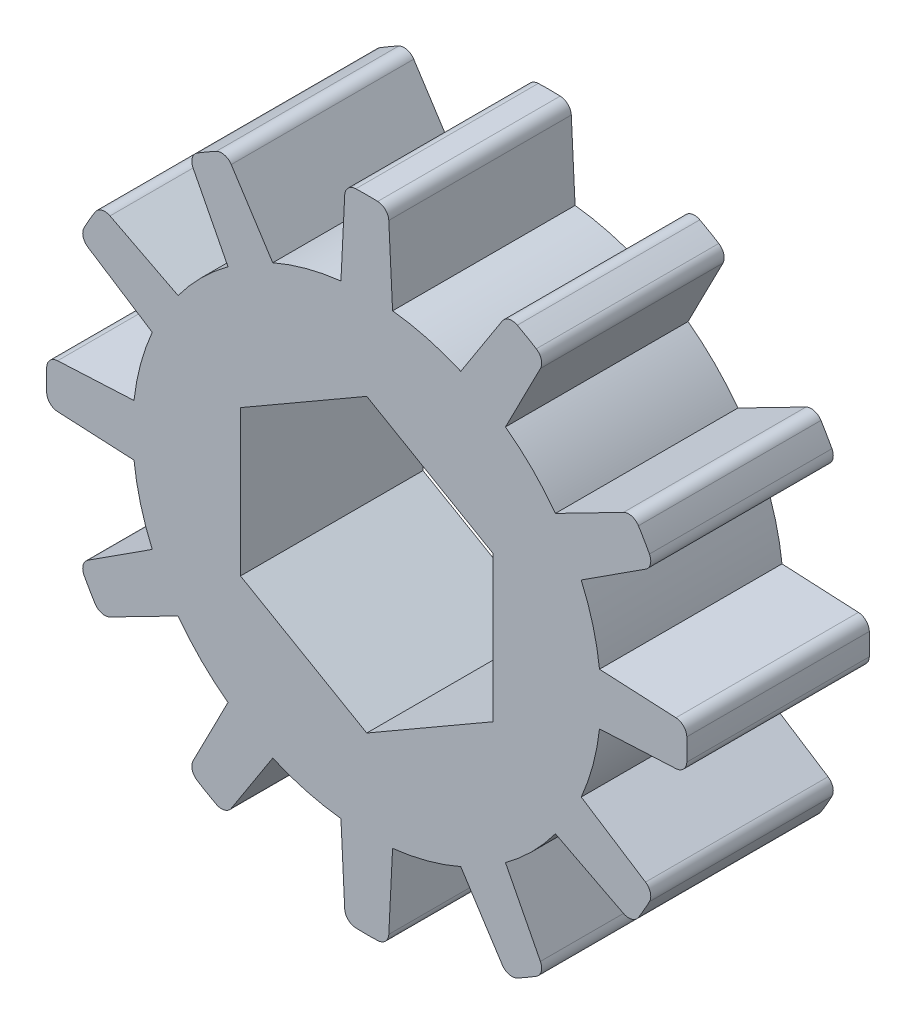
ISO-10303-21;
HEADER;
FILE_DESCRIPTION(('STEP AP214'),'2;1');
FILE_NAME('part.step','',(''),(''),'','','');
FILE_SCHEMA(('AUTOMOTIVE_DESIGN { 1 0 10303 214 1 1 1 1 }'));
ENDSEC;
DATA;
#1=APPLICATION_CONTEXT('core data for automotive mechanical design processes');
#2=APPLICATION_PROTOCOL_DEFINITION('international standard','automotive_design',2000,#1);
#3=PRODUCT_CONTEXT('',#1,'mechanical');
#4=PRODUCT('Part','Part','',(#3));
#5=PRODUCT_RELATED_PRODUCT_CATEGORY('part','',(#4));
#6=PRODUCT_DEFINITION_FORMATION('','',#4);
#7=PRODUCT_DEFINITION_CONTEXT('part definition',#1,'design');
#8=PRODUCT_DEFINITION('design','',#6,#7);
#9=PRODUCT_DEFINITION_SHAPE('','',#8);
#10=(LENGTH_UNIT() NAMED_UNIT(*) SI_UNIT(.MILLI.,.METRE.));
#11=(NAMED_UNIT(*) PLANE_ANGLE_UNIT() SI_UNIT($,.RADIAN.));
#12=(NAMED_UNIT(*) SI_UNIT($,.STERADIAN.) SOLID_ANGLE_UNIT());
#13=UNCERTAINTY_MEASURE_WITH_UNIT(LENGTH_MEASURE(1.E-05),#10,'distance_accuracy_value','');
#14=(GEOMETRIC_REPRESENTATION_CONTEXT(3) GLOBAL_UNCERTAINTY_ASSIGNED_CONTEXT((#13)) GLOBAL_UNIT_ASSIGNED_CONTEXT((#10,
#11,#12)) REPRESENTATION_CONTEXT('',''));
#15=CARTESIAN_POINT('',(0.,0.,0.));
#16=DIRECTION('',(0.,0.,1.));
#17=DIRECTION('',(1.,0.,0.));
#18=AXIS2_PLACEMENT_3D('',#15,#16,#17);
#19=CARTESIAN_POINT('',(0.,0.,3.18));
#20=DIRECTION('',(0.,0.,1.));
#21=DIRECTION('',(1.,0.,0.));
#22=AXIS2_PLACEMENT_3D('',#19,#20,#21);
#23=PLANE('',#22);
#24=DIRECTION('',(-0.866025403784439,-0.5,0.));
#25=VECTOR('',#24,1.);
#26=CARTESIAN_POINT('',(2.2,-1.27017059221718,3.18));
#27=LINE('',#26,#25);
#28=CARTESIAN_POINT('',(2.2,-1.27017059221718,3.18));
#29=VERTEX_POINT('',#28);
#30=CARTESIAN_POINT('',(0.,-2.54034118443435,3.18));
#31=VERTEX_POINT('',#30);
#32=EDGE_CURVE('E528',#29,#31,#27,.T.);
#33=ORIENTED_EDGE('',*,*,#32,.T.);
#34=DIRECTION('',(-0.866025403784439,0.5,0.));
#35=VECTOR('',#34,1.);
#36=CARTESIAN_POINT('',(0.,-2.54034118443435,3.18));
#37=LINE('',#36,#35);
#38=CARTESIAN_POINT('',(-2.2,-1.27017059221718,3.18));
#39=VERTEX_POINT('',#38);
#40=EDGE_CURVE('E540',#31,#39,#37,.T.);
#41=ORIENTED_EDGE('',*,*,#40,.T.);
#42=DIRECTION('',(0.,1.,0.));
#43=VECTOR('',#42,1.);
#44=CARTESIAN_POINT('',(-2.2,-1.27017059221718,3.18));
#45=LINE('',#44,#43);
#46=CARTESIAN_POINT('',(-2.2,1.27017059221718,3.18));
#47=VERTEX_POINT('',#46);
#48=EDGE_CURVE('E544',#39,#47,#45,.T.);
#49=ORIENTED_EDGE('',*,*,#48,.T.);
#50=DIRECTION('',(0.866025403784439,0.5,0.));
#51=VECTOR('',#50,1.);
#52=CARTESIAN_POINT('',(-2.2,1.27017059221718,3.18));
#53=LINE('',#52,#51);
#54=CARTESIAN_POINT('',(0.,2.54034118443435,3.18));
#55=VERTEX_POINT('',#54);
#56=EDGE_CURVE('E555',#47,#55,#53,.T.);
#57=ORIENTED_EDGE('',*,*,#56,.T.);
#58=DIRECTION('',(0.866025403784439,-0.5,0.));
#59=VECTOR('',#58,1.);
#60=CARTESIAN_POINT('',(0.,2.54034118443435,3.18));
#61=LINE('',#60,#59);
#62=CARTESIAN_POINT('',(2.2,1.27017059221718,3.18));
#63=VERTEX_POINT('',#62);
#64=EDGE_CURVE('E558',#55,#63,#61,.T.);
#65=ORIENTED_EDGE('',*,*,#64,.T.);
#66=DIRECTION('',(0.,-1.,0.));
#67=VECTOR('',#66,1.);
#68=CARTESIAN_POINT('',(2.2,1.27017059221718,3.18));
#69=LINE('',#68,#67);
#70=EDGE_CURVE('E536',#63,#29,#69,.T.);
#71=ORIENTED_EDGE('',*,*,#70,.T.);
#72=EDGE_LOOP('',(#33,#41,#49,#57,#65,#71));
#73=FACE_BOUND('',#72,.T.);
#74=DIRECTION('',(0.99877247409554,0.0495332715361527,0.));
#75=VECTOR('',#74,1.);
#76=CARTESIAN_POINT('',(5.56787554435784,-0.375,3.18));
#77=LINE('',#76,#75);
#78=CARTESIAN_POINT('',(4.0556003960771,-0.45,3.18));
#79=VERTEX_POINT('',#78);
#80=CARTESIAN_POINT('',(5.38724207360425,-0.383958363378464,3.18));
#81=VERTEX_POINT('',#80);
#82=EDGE_CURVE('E670',#79,#81,#77,.T.);
#83=ORIENTED_EDGE('',*,*,#82,.T.);
#84=CARTESIAN_POINT('',(5.37733541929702,-0.184203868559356,3.18));
#85=DIRECTION('',(0.,0.,1.));
#86=DIRECTION('',(1.,0.,0.));
#87=AXIS2_PLACEMENT_3D('',#84,#85,#86);
#88=CIRCLE('',#87,0.2);
#89=CARTESIAN_POINT('',(5.57721817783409,-0.191050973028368,3.18));
#90=VERTEX_POINT('',#89);
#91=EDGE_CURVE('E990',#81,#90,#88,.T.);
#92=ORIENTED_EDGE('',*,*,#91,.T.);
#93=CARTESIAN_POINT('',(0.,0.,3.18));
#94=DIRECTION('',(0.,0.,1.));
#95=DIRECTION('',(1.,0.,0.));
#96=AXIS2_PLACEMENT_3D('',#93,#94,#95);
#97=CIRCLE('',#96,5.58048950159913);
#98=CARTESIAN_POINT('',(5.57721817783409,0.191050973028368,3.18));
#99=VERTEX_POINT('',#98);
#100=EDGE_CURVE('E673',#90,#99,#97,.T.);
#101=ORIENTED_EDGE('',*,*,#100,.T.);
#102=CARTESIAN_POINT('',(5.37733541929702,0.184203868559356,3.18));
#103=DIRECTION('',(0.,0.,1.));
#104=DIRECTION('',(1.,0.,0.));
#105=AXIS2_PLACEMENT_3D('',#102,#103,#104);
#106=CIRCLE('',#105,0.2);
#107=CARTESIAN_POINT('',(5.38724207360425,0.383958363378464,3.18));
#108=VERTEX_POINT('',#107);
#109=EDGE_CURVE('E956',#99,#108,#106,.T.);
#110=ORIENTED_EDGE('',*,*,#109,.T.);
#111=DIRECTION('',(-0.99877247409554,0.0495332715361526,0.));
#112=VECTOR('',#111,1.);
#113=CARTESIAN_POINT('',(5.56787554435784,0.375,3.18));
#114=LINE('',#113,#112);
#115=CARTESIAN_POINT('',(4.0556003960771,0.45,3.18));
#116=VERTEX_POINT('',#115);
#117=EDGE_CURVE('E676',#108,#116,#114,.T.);
#118=ORIENTED_EDGE('',*,*,#117,.T.);
#119=CARTESIAN_POINT('',(0.,0.,3.18));
#120=DIRECTION('',(0.,0.,1.));
#121=DIRECTION('',(1.,0.,0.));
#122=AXIS2_PLACEMENT_3D('',#119,#120,#121);
#123=CIRCLE('',#122,4.08048950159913);
#124=CARTESIAN_POINT('',(3.737252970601,1.63808876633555,3.18));
#125=VERTEX_POINT('',#124);
#126=EDGE_CURVE('E678',#116,#125,#123,.T.);
#127=ORIENTED_EDGE('',*,*,#126,.T.);
#128=DIRECTION('',(0.840195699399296,0.542283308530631,0.));
#129=VECTOR('',#128,1.);
#130=CARTESIAN_POINT('',(5.009421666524,2.45917824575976,3.18));
#131=LINE('',#130,#129);
#132=CARTESIAN_POINT('',(4.85746767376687,2.36110334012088,3.18));
#133=VERTEX_POINT('',#132);
#134=EDGE_CURVE('E680',#125,#133,#131,.T.);
#135=ORIENTED_EDGE('',*,*,#134,.T.);
#136=CARTESIAN_POINT('',(4.74901101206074,2.52914248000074,3.18));
#137=DIRECTION('',(0.,0.,1.));
#138=DIRECTION('',(1.,0.,0.));
#139=AXIS2_PLACEMENT_3D('',#136,#137,#138);
#140=CIRCLE('',#139,0.2);
#141=CARTESIAN_POINT('',(4.92553811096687,2.62315409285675,3.18));
#142=VERTEX_POINT('',#141);
#143=EDGE_CURVE('E954',#133,#142,#140,.T.);
#144=ORIENTED_EDGE('',*,*,#143,.T.);
#145=CARTESIAN_POINT('',(0.,0.,3.18));
#146=DIRECTION('',(0.,0.,1.));
#147=DIRECTION('',(1.,0.,0.));
#148=AXIS2_PLACEMENT_3D('',#145,#146,#147);
#149=CIRCLE('',#148,5.58048950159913);
#150=CARTESIAN_POINT('',(4.7344871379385,2.95406408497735,3.18));
#151=VERTEX_POINT('',#150);
#152=EDGE_CURVE('E683',#142,#151,#149,.T.);
#153=ORIENTED_EDGE('',*,*,#152,.T.);
#154=CARTESIAN_POINT('',(4.56480714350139,2.84819293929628,3.18));
#155=DIRECTION('',(0.,0.,1.));
#156=DIRECTION('',(1.,0.,0.));
#157=AXIS2_PLACEMENT_3D('',#154,#155,#156);
#158=CIRCLE('',#157,0.2);
#159=CARTESIAN_POINT('',(4.4735093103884,3.02613873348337,3.18));
#160=VERTEX_POINT('',#159);
#161=EDGE_CURVE('E952',#151,#160,#158,.T.);
#162=ORIENTED_EDGE('',*,*,#161,.T.);
#163=DIRECTION('',(-0.889728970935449,-0.456489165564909,0.));
#164=VECTOR('',#163,1.);
#165=CARTESIAN_POINT('',(4.634421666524,3.10869729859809,3.18));
#166=LINE('',#165,#164);
#167=CARTESIAN_POINT('',(3.287252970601,2.41751162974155,3.18));
#168=VERTEX_POINT('',#167);
#169=EDGE_CURVE('E686',#160,#168,#166,.T.);
#170=ORIENTED_EDGE('',*,*,#169,.T.);
#171=CARTESIAN_POINT('',(0.,0.,3.18));
#172=DIRECTION('',(0.,0.,1.));
#173=DIRECTION('',(1.,0.,0.));
#174=AXIS2_PLACEMENT_3D('',#171,#172,#173);
#175=CIRCLE('',#174,4.08048950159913);
#176=CARTESIAN_POINT('',(2.41751162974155,3.287252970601,3.18));
#177=VERTEX_POINT('',#176);
#178=EDGE_CURVE('E688',#168,#177,#175,.T.);
#179=ORIENTED_EDGE('',*,*,#178,.T.);
#180=DIRECTION('',(0.456489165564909,0.889728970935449,0.));
#181=VECTOR('',#180,1.);
#182=CARTESIAN_POINT('',(3.10869729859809,4.634421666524,3.18));
#183=LINE('',#182,#181);
#184=CARTESIAN_POINT('',(3.02613873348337,4.47350931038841,3.18));
#185=VERTEX_POINT('',#184);
#186=EDGE_CURVE('E690',#177,#185,#183,.T.);
#187=ORIENTED_EDGE('',*,*,#186,.T.);
#188=CARTESIAN_POINT('',(2.84819293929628,4.56480714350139,3.18));
#189=DIRECTION('',(0.,0.,1.));
#190=DIRECTION('',(1.,0.,0.));
#191=AXIS2_PLACEMENT_3D('',#188,#189,#190);
#192=CIRCLE('',#191,0.2);
#193=CARTESIAN_POINT('',(2.95406408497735,4.7344871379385,3.18));
#194=VERTEX_POINT('',#193);
#195=EDGE_CURVE('E950',#185,#194,#192,.T.);
#196=ORIENTED_EDGE('',*,*,#195,.T.);
#197=CARTESIAN_POINT('',(0.,0.,3.18));
#198=DIRECTION('',(0.,0.,1.));
#199=DIRECTION('',(1.,0.,0.));
#200=AXIS2_PLACEMENT_3D('',#197,#198,#199);
#201=CIRCLE('',#200,5.58048950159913);
#202=CARTESIAN_POINT('',(2.62315409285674,4.92553811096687,3.18));
#203=VERTEX_POINT('',#202);
#204=EDGE_CURVE('E693',#194,#203,#201,.T.);
#205=ORIENTED_EDGE('',*,*,#204,.T.);
#206=CARTESIAN_POINT('',(2.52914248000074,4.74901101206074,3.18));
#207=DIRECTION('',(0.,0.,1.));
#208=DIRECTION('',(1.,0.,0.));
#209=AXIS2_PLACEMENT_3D('',#206,#207,#208);
#210=CIRCLE('',#209,0.2);
#211=CARTESIAN_POINT('',(2.36110334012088,4.85746767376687,3.18));
#212=VERTEX_POINT('',#211);
#213=EDGE_CURVE('E59',#203,#212,#210,.T.);
#214=ORIENTED_EDGE('',*,*,#213,.T.);
#215=DIRECTION('',(-0.54228330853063,-0.840195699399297,0.));
#216=VECTOR('',#215,1.);
#217=CARTESIAN_POINT('',(2.45917824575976,5.009421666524,3.18));
#218=LINE('',#217,#216);
#219=CARTESIAN_POINT('',(1.63808876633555,3.737252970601,3.18));
#220=VERTEX_POINT('',#219);
#221=EDGE_CURVE('E695',#212,#220,#218,.T.);
#222=ORIENTED_EDGE('',*,*,#221,.T.);
#223=CARTESIAN_POINT('',(0.,0.,3.18));
#224=DIRECTION('',(0.,0.,1.));
#225=DIRECTION('',(1.,0.,0.));
#226=AXIS2_PLACEMENT_3D('',#223,#224,#225);
#227=CIRCLE('',#226,4.08048950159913);
#228=CARTESIAN_POINT('',(0.45,4.0556003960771,3.18));
#229=VERTEX_POINT('',#228);
#230=EDGE_CURVE('E697',#220,#229,#227,.T.);
#231=ORIENTED_EDGE('',*,*,#230,.T.);
#232=DIRECTION('',(-0.0495332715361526,0.99877247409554,0.));
#233=VECTOR('',#232,1.);
#234=CARTESIAN_POINT('',(0.375,5.56787554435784,3.18));
#235=LINE('',#234,#233);
#236=CARTESIAN_POINT('',(0.383958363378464,5.38724207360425,3.18));
#237=VERTEX_POINT('',#236);
#238=EDGE_CURVE('E699',#229,#237,#235,.T.);
#239=ORIENTED_EDGE('',*,*,#238,.T.);
#240=CARTESIAN_POINT('',(0.184203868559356,5.37733541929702,3.18));
#241=DIRECTION('',(0.,0.,1.));
#242=DIRECTION('',(1.,0.,0.));
#243=AXIS2_PLACEMENT_3D('',#240,#241,#242);
#244=CIRCLE('',#243,0.2);
#245=CARTESIAN_POINT('',(0.191050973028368,5.57721817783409,3.18));
#246=VERTEX_POINT('',#245);
#247=EDGE_CURVE('E947',#237,#246,#244,.T.);
#248=ORIENTED_EDGE('',*,*,#247,.T.);
#249=CARTESIAN_POINT('',(0.,0.,3.18));
#250=DIRECTION('',(0.,0.,1.));
#251=DIRECTION('',(1.,0.,0.));
#252=AXIS2_PLACEMENT_3D('',#249,#250,#251);
#253=CIRCLE('',#252,5.58048950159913);
#254=CARTESIAN_POINT('',(-0.191050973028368,5.57721817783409,3.18));
#255=VERTEX_POINT('',#254);
#256=EDGE_CURVE('E582',#246,#255,#253,.T.);
#257=ORIENTED_EDGE('',*,*,#256,.T.);
#258=CARTESIAN_POINT('',(-0.184203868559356,5.37733541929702,3.18));
#259=DIRECTION('',(0.,0.,1.));
#260=DIRECTION('',(1.,0.,0.));
#261=AXIS2_PLACEMENT_3D('',#258,#259,#260);
#262=CIRCLE('',#261,0.2);
#263=CARTESIAN_POINT('',(-0.383958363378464,5.38724207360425,3.18));
#264=VERTEX_POINT('',#263);
#265=EDGE_CURVE('E945',#255,#264,#262,.T.);
#266=ORIENTED_EDGE('',*,*,#265,.T.);
#267=DIRECTION('',(-0.0495332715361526,-0.99877247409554,0.));
#268=VECTOR('',#267,1.);
#269=CARTESIAN_POINT('',(-0.375,5.56787554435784,3.18));
#270=LINE('',#269,#268);
#271=CARTESIAN_POINT('',(-0.45,4.0556003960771,3.18));
#272=VERTEX_POINT('',#271);
#273=EDGE_CURVE('E585',#264,#272,#270,.T.);
#274=ORIENTED_EDGE('',*,*,#273,.T.);
#275=CARTESIAN_POINT('',(0.,0.,3.18));
#276=DIRECTION('',(0.,0.,1.));
#277=DIRECTION('',(1.,0.,0.));
#278=AXIS2_PLACEMENT_3D('',#275,#276,#277);
#279=CIRCLE('',#278,4.08048950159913);
#280=CARTESIAN_POINT('',(-1.63808876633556,3.737252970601,3.18));
#281=VERTEX_POINT('',#280);
#282=EDGE_CURVE('E588',#272,#281,#279,.T.);
#283=ORIENTED_EDGE('',*,*,#282,.T.);
#284=DIRECTION('',(-0.542283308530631,0.840195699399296,0.));
#285=VECTOR('',#284,1.);
#286=CARTESIAN_POINT('',(-2.45917824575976,5.009421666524,3.18));
#287=LINE('',#286,#285);
#288=CARTESIAN_POINT('',(-2.36110334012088,4.85746767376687,3.18));
#289=VERTEX_POINT('',#288);
#290=EDGE_CURVE('E590',#281,#289,#287,.T.);
#291=ORIENTED_EDGE('',*,*,#290,.T.);
#292=CARTESIAN_POINT('',(-2.52914248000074,4.74901101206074,3.18));
#293=DIRECTION('',(0.,0.,1.));
#294=DIRECTION('',(1.,0.,0.));
#295=AXIS2_PLACEMENT_3D('',#292,#293,#294);
#296=CIRCLE('',#295,0.2);
#297=CARTESIAN_POINT('',(-2.62315409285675,4.92553811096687,3.18));
#298=VERTEX_POINT('',#297);
#299=EDGE_CURVE('E958',#289,#298,#296,.T.);
#300=ORIENTED_EDGE('',*,*,#299,.T.);
#301=CARTESIAN_POINT('',(0.,0.,3.18));
#302=DIRECTION('',(0.,0.,1.));
#303=DIRECTION('',(1.,0.,0.));
#304=AXIS2_PLACEMENT_3D('',#301,#302,#303);
#305=CIRCLE('',#304,5.58048950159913);
#306=CARTESIAN_POINT('',(-2.95406408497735,4.7344871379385,3.18));
#307=VERTEX_POINT('',#306);
#308=EDGE_CURVE('E593',#298,#307,#305,.T.);
#309=ORIENTED_EDGE('',*,*,#308,.T.);
#310=CARTESIAN_POINT('',(-2.84819293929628,4.56480714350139,3.18));
#311=DIRECTION('',(0.,0.,1.));
#312=DIRECTION('',(1.,0.,0.));
#313=AXIS2_PLACEMENT_3D('',#310,#311,#312);
#314=CIRCLE('',#313,0.2);
#315=CARTESIAN_POINT('',(-3.02613873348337,4.4735093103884,3.18));
#316=VERTEX_POINT('',#315);
#317=EDGE_CURVE('E960',#307,#316,#314,.T.);
#318=ORIENTED_EDGE('',*,*,#317,.T.);
#319=DIRECTION('',(0.456489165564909,-0.889728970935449,0.));
#320=VECTOR('',#319,1.);
#321=CARTESIAN_POINT('',(-3.10869729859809,4.634421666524,3.18));
#322=LINE('',#321,#320);
#323=CARTESIAN_POINT('',(-2.41751162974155,3.287252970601,3.18));
#324=VERTEX_POINT('',#323);
#325=EDGE_CURVE('E596',#316,#324,#322,.T.);
#326=ORIENTED_EDGE('',*,*,#325,.T.);
#327=CARTESIAN_POINT('',(0.,0.,3.18));
#328=DIRECTION('',(0.,0.,1.));
#329=DIRECTION('',(1.,0.,0.));
#330=AXIS2_PLACEMENT_3D('',#327,#328,#329);
#331=CIRCLE('',#330,4.08048950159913);
#332=CARTESIAN_POINT('',(-3.287252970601,2.41751162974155,3.18));
#333=VERTEX_POINT('',#332);
#334=EDGE_CURVE('E598',#324,#333,#331,.T.);
#335=ORIENTED_EDGE('',*,*,#334,.T.);
#336=DIRECTION('',(-0.889728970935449,0.456489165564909,0.));
#337=VECTOR('',#336,1.);
#338=CARTESIAN_POINT('',(-4.634421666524,3.10869729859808,3.18));
#339=LINE('',#338,#337);
#340=CARTESIAN_POINT('',(-4.47350931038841,3.02613873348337,3.18));
#341=VERTEX_POINT('',#340);
#342=EDGE_CURVE('E600',#333,#341,#339,.T.);
#343=ORIENTED_EDGE('',*,*,#342,.T.);
#344=CARTESIAN_POINT('',(-4.56480714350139,2.84819293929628,3.18));
#345=DIRECTION('',(0.,0.,1.));
#346=DIRECTION('',(1.,0.,0.));
#347=AXIS2_PLACEMENT_3D('',#344,#345,#346);
#348=CIRCLE('',#347,0.2);
#349=CARTESIAN_POINT('',(-4.7344871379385,2.95406408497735,3.18));
#350=VERTEX_POINT('',#349);
#351=EDGE_CURVE('E962',#341,#350,#348,.T.);
#352=ORIENTED_EDGE('',*,*,#351,.T.);
#353=CARTESIAN_POINT('',(0.,0.,3.18));
#354=DIRECTION('',(0.,0.,1.));
#355=DIRECTION('',(1.,0.,0.));
#356=AXIS2_PLACEMENT_3D('',#353,#354,#355);
#357=CIRCLE('',#356,5.58048950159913);
#358=CARTESIAN_POINT('',(-4.92553811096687,2.62315409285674,3.18));
#359=VERTEX_POINT('',#358);
#360=EDGE_CURVE('E603',#350,#359,#357,.T.);
#361=ORIENTED_EDGE('',*,*,#360,.T.);
#362=CARTESIAN_POINT('',(-4.74901101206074,2.52914248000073,3.18));
#363=DIRECTION('',(0.,0.,1.));
#364=DIRECTION('',(1.,0.,0.));
#365=AXIS2_PLACEMENT_3D('',#362,#363,#364);
#366=CIRCLE('',#365,0.2);
#367=CARTESIAN_POINT('',(-4.85746767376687,2.36110334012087,3.18));
#368=VERTEX_POINT('',#367);
#369=EDGE_CURVE('E964',#359,#368,#366,.T.);
#370=ORIENTED_EDGE('',*,*,#369,.T.);
#371=DIRECTION('',(0.840195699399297,-0.54228330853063,0.));
#372=VECTOR('',#371,1.);
#373=CARTESIAN_POINT('',(-5.009421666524,2.45917824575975,3.18));
#374=LINE('',#373,#372);
#375=CARTESIAN_POINT('',(-3.737252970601,1.63808876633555,3.18));
#376=VERTEX_POINT('',#375);
#377=EDGE_CURVE('E606',#368,#376,#374,.T.);
#378=ORIENTED_EDGE('',*,*,#377,.T.);
#379=CARTESIAN_POINT('',(0.,0.,3.18));
#380=DIRECTION('',(0.,0.,1.));
#381=DIRECTION('',(1.,0.,0.));
#382=AXIS2_PLACEMENT_3D('',#379,#380,#381);
#383=CIRCLE('',#382,4.08048950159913);
#384=CARTESIAN_POINT('',(-4.0556003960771,0.449999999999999,3.18));
#385=VERTEX_POINT('',#384);
#386=EDGE_CURVE('E608',#376,#385,#383,.T.);
#387=ORIENTED_EDGE('',*,*,#386,.T.);
#388=DIRECTION('',(-0.99877247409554,-0.0495332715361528,0.));
#389=VECTOR('',#388,1.);
#390=CARTESIAN_POINT('',(-5.56787554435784,0.374999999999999,3.18));
#391=LINE('',#390,#389);
#392=CARTESIAN_POINT('',(-5.38724207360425,0.383958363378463,3.18));
#393=VERTEX_POINT('',#392);
#394=EDGE_CURVE('E610',#385,#393,#391,.T.);
#395=ORIENTED_EDGE('',*,*,#394,.T.);
#396=CARTESIAN_POINT('',(-5.37733541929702,0.184203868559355,3.18));
#397=DIRECTION('',(0.,0.,1.));
#398=DIRECTION('',(1.,0.,0.));
#399=AXIS2_PLACEMENT_3D('',#396,#397,#398);
#400=CIRCLE('',#399,0.2);
#401=CARTESIAN_POINT('',(-5.57721817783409,0.191050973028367,3.18));
#402=VERTEX_POINT('',#401);
#403=EDGE_CURVE('E966',#393,#402,#400,.T.);
#404=ORIENTED_EDGE('',*,*,#403,.T.);
#405=CARTESIAN_POINT('',(0.,0.,3.18));
#406=DIRECTION('',(0.,0.,1.));
#407=DIRECTION('',(1.,0.,0.));
#408=AXIS2_PLACEMENT_3D('',#405,#406,#407);
#409=CIRCLE('',#408,5.58048950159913);
#410=CARTESIAN_POINT('',(-5.57721817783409,-0.191050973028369,3.18));
#411=VERTEX_POINT('',#410);
#412=EDGE_CURVE('E613',#402,#411,#409,.T.);
#413=ORIENTED_EDGE('',*,*,#412,.T.);
#414=CARTESIAN_POINT('',(-5.37733541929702,-0.184203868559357,3.18));
#415=DIRECTION('',(0.,0.,1.));
#416=DIRECTION('',(1.,0.,0.));
#417=AXIS2_PLACEMENT_3D('',#414,#415,#416);
#418=CIRCLE('',#417,0.2);
#419=CARTESIAN_POINT('',(-5.38724207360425,-0.383958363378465,3.18));
#420=VERTEX_POINT('',#419);
#421=EDGE_CURVE('E968',#411,#420,#418,.T.);
#422=ORIENTED_EDGE('',*,*,#421,.T.);
#423=DIRECTION('',(0.99877247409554,-0.0495332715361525,0.));
#424=VECTOR('',#423,1.);
#425=CARTESIAN_POINT('',(-5.56787554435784,-0.375000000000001,3.18));
#426=LINE('',#425,#424);
#427=CARTESIAN_POINT('',(-4.0556003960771,-0.449999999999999,3.18));
#428=VERTEX_POINT('',#427);
#429=EDGE_CURVE('E616',#420,#428,#426,.T.);
#430=ORIENTED_EDGE('',*,*,#429,.T.);
#431=CARTESIAN_POINT('',(0.,0.,3.18));
#432=DIRECTION('',(0.,0.,1.));
#433=DIRECTION('',(1.,0.,0.));
#434=AXIS2_PLACEMENT_3D('',#431,#432,#433);
#435=CIRCLE('',#434,4.08048950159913);
#436=CARTESIAN_POINT('',(-3.737252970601,-1.63808876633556,3.18));
#437=VERTEX_POINT('',#436);
#438=EDGE_CURVE('E618',#428,#437,#435,.T.);
#439=ORIENTED_EDGE('',*,*,#438,.T.);
#440=DIRECTION('',(-0.840195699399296,-0.542283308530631,0.));
#441=VECTOR('',#440,1.);
#442=CARTESIAN_POINT('',(-5.009421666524,-2.45917824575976,3.18));
#443=LINE('',#442,#441);
#444=CARTESIAN_POINT('',(-4.85746767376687,-2.36110334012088,3.18));
#445=VERTEX_POINT('',#444);
#446=EDGE_CURVE('E620',#437,#445,#443,.T.);
#447=ORIENTED_EDGE('',*,*,#446,.T.);
#448=CARTESIAN_POINT('',(-4.74901101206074,-2.52914248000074,3.18));
#449=DIRECTION('',(0.,0.,1.));
#450=DIRECTION('',(1.,0.,0.));
#451=AXIS2_PLACEMENT_3D('',#448,#449,#450);
#452=CIRCLE('',#451,0.2);
#453=CARTESIAN_POINT('',(-4.92553811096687,-2.62315409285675,3.18));
#454=VERTEX_POINT('',#453);
#455=EDGE_CURVE('E970',#445,#454,#452,.T.);
#456=ORIENTED_EDGE('',*,*,#455,.T.);
#457=CARTESIAN_POINT('',(0.,0.,3.18));
#458=DIRECTION('',(0.,0.,1.));
#459=DIRECTION('',(1.,0.,0.));
#460=AXIS2_PLACEMENT_3D('',#457,#458,#459);
#461=CIRCLE('',#460,5.58048950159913);
#462=CARTESIAN_POINT('',(-4.7344871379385,-2.95406408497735,3.18));
#463=VERTEX_POINT('',#462);
#464=EDGE_CURVE('E623',#454,#463,#461,.T.);
#465=ORIENTED_EDGE('',*,*,#464,.T.);
#466=CARTESIAN_POINT('',(-4.56480714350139,-2.84819293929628,3.18));
#467=DIRECTION('',(0.,0.,1.));
#468=DIRECTION('',(1.,0.,0.));
#469=AXIS2_PLACEMENT_3D('',#466,#467,#468);
#470=CIRCLE('',#469,0.2);
#471=CARTESIAN_POINT('',(-4.4735093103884,-3.02613873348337,3.18));
#472=VERTEX_POINT('',#471);
#473=EDGE_CURVE('E972',#463,#472,#470,.T.);
#474=ORIENTED_EDGE('',*,*,#473,.T.);
#475=DIRECTION('',(0.889728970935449,0.456489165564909,0.));
#476=VECTOR('',#475,1.);
#477=CARTESIAN_POINT('',(-4.634421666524,-3.10869729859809,3.18));
#478=LINE('',#477,#476);
#479=CARTESIAN_POINT('',(-3.287252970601,-2.41751162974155,3.18));
#480=VERTEX_POINT('',#479);
#481=EDGE_CURVE('E626',#472,#480,#478,.T.);
#482=ORIENTED_EDGE('',*,*,#481,.T.);
#483=CARTESIAN_POINT('',(0.,0.,3.18));
#484=DIRECTION('',(0.,0.,1.));
#485=DIRECTION('',(1.,0.,0.));
#486=AXIS2_PLACEMENT_3D('',#483,#484,#485);
#487=CIRCLE('',#486,4.08048950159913);
#488=CARTESIAN_POINT('',(-2.41751162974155,-3.287252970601,3.18));
#489=VERTEX_POINT('',#488);
#490=EDGE_CURVE('E628',#480,#489,#487,.T.);
#491=ORIENTED_EDGE('',*,*,#490,.T.);
#492=DIRECTION('',(-0.456489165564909,-0.889728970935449,0.));
#493=VECTOR('',#492,1.);
#494=CARTESIAN_POINT('',(-3.10869729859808,-4.634421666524,3.18));
#495=LINE('',#494,#493);
#496=CARTESIAN_POINT('',(-3.02613873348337,-4.47350931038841,3.18));
#497=VERTEX_POINT('',#496);
#498=EDGE_CURVE('E630',#489,#497,#495,.T.);
#499=ORIENTED_EDGE('',*,*,#498,.T.);
#500=CARTESIAN_POINT('',(-2.84819293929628,-4.56480714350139,3.18));
#501=DIRECTION('',(0.,0.,1.));
#502=DIRECTION('',(1.,0.,0.));
#503=AXIS2_PLACEMENT_3D('',#500,#501,#502);
#504=CIRCLE('',#503,0.2);
#505=CARTESIAN_POINT('',(-2.95406408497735,-4.7344871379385,3.18));
#506=VERTEX_POINT('',#505);
#507=EDGE_CURVE('E986',#497,#506,#504,.T.);
#508=ORIENTED_EDGE('',*,*,#507,.T.);
#509=CARTESIAN_POINT('',(0.,0.,3.18));
#510=DIRECTION('',(0.,0.,1.));
#511=DIRECTION('',(1.,0.,0.));
#512=AXIS2_PLACEMENT_3D('',#509,#510,#511);
#513=CIRCLE('',#512,5.58048950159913);
#514=CARTESIAN_POINT('',(-2.62315409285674,-4.92553811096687,3.18));
#515=VERTEX_POINT('',#514);
#516=EDGE_CURVE('E633',#506,#515,#513,.T.);
#517=ORIENTED_EDGE('',*,*,#516,.T.);
#518=CARTESIAN_POINT('',(-2.52914248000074,-4.74901101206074,3.18));
#519=DIRECTION('',(0.,0.,1.));
#520=DIRECTION('',(1.,0.,0.));
#521=AXIS2_PLACEMENT_3D('',#518,#519,#520);
#522=CIRCLE('',#521,0.2);
#523=CARTESIAN_POINT('',(-2.36110334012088,-4.85746767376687,3.18));
#524=VERTEX_POINT('',#523);
#525=EDGE_CURVE('E988',#515,#524,#522,.T.);
#526=ORIENTED_EDGE('',*,*,#525,.T.);
#527=DIRECTION('',(0.542283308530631,0.840195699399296,0.));
#528=VECTOR('',#527,1.);
#529=CARTESIAN_POINT('',(-2.45917824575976,-5.009421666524,3.18));
#530=LINE('',#529,#528);
#531=CARTESIAN_POINT('',(-1.63808876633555,-3.737252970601,3.18));
#532=VERTEX_POINT('',#531);
#533=EDGE_CURVE('E636',#524,#532,#530,.T.);
#534=ORIENTED_EDGE('',*,*,#533,.T.);
#535=CARTESIAN_POINT('',(0.,0.,3.18));
#536=DIRECTION('',(0.,0.,1.));
#537=DIRECTION('',(1.,0.,0.));
#538=AXIS2_PLACEMENT_3D('',#535,#536,#537);
#539=CIRCLE('',#538,4.08048950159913);
#540=CARTESIAN_POINT('',(-0.45,-4.0556003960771,3.18));
#541=VERTEX_POINT('',#540);
#542=EDGE_CURVE('E638',#532,#541,#539,.T.);
#543=ORIENTED_EDGE('',*,*,#542,.T.);
#544=DIRECTION('',(0.0495332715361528,-0.99877247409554,0.));
#545=VECTOR('',#544,1.);
#546=CARTESIAN_POINT('',(-0.374999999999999,-5.56787554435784,3.18));
#547=LINE('',#546,#545);
#548=CARTESIAN_POINT('',(-0.383958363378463,-5.38724207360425,3.18));
#549=VERTEX_POINT('',#548);
#550=EDGE_CURVE('E640',#541,#549,#547,.T.);
#551=ORIENTED_EDGE('',*,*,#550,.T.);
#552=CARTESIAN_POINT('',(-0.184203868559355,-5.37733541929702,3.18));
#553=DIRECTION('',(0.,0.,1.));
#554=DIRECTION('',(1.,0.,0.));
#555=AXIS2_PLACEMENT_3D('',#552,#553,#554);
#556=CIRCLE('',#555,0.2);
#557=CARTESIAN_POINT('',(-0.191050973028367,-5.57721817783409,3.18));
#558=VERTEX_POINT('',#557);
#559=EDGE_CURVE('E982',#549,#558,#556,.T.);
#560=ORIENTED_EDGE('',*,*,#559,.T.);
#561=CARTESIAN_POINT('',(0.,0.,3.18));
#562=DIRECTION('',(0.,0.,1.));
#563=DIRECTION('',(1.,0.,0.));
#564=AXIS2_PLACEMENT_3D('',#561,#562,#563);
#565=CIRCLE('',#564,5.58048950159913);
#566=CARTESIAN_POINT('',(0.191050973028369,-5.57721817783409,3.18));
#567=VERTEX_POINT('',#566);
#568=EDGE_CURVE('E643',#558,#567,#565,.T.);
#569=ORIENTED_EDGE('',*,*,#568,.T.);
#570=CARTESIAN_POINT('',(0.184203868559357,-5.37733541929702,3.18));
#571=DIRECTION('',(0.,0.,1.));
#572=DIRECTION('',(1.,0.,0.));
#573=AXIS2_PLACEMENT_3D('',#570,#571,#572);
#574=CIRCLE('',#573,0.2);
#575=CARTESIAN_POINT('',(0.383958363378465,-5.38724207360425,3.18));
#576=VERTEX_POINT('',#575);
#577=EDGE_CURVE('E984',#567,#576,#574,.T.);
#578=ORIENTED_EDGE('',*,*,#577,.T.);
#579=DIRECTION('',(0.0495332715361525,0.99877247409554,0.));
#580=VECTOR('',#579,1.);
#581=CARTESIAN_POINT('',(0.375000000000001,-5.56787554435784,3.18));
#582=LINE('',#581,#580);
#583=CARTESIAN_POINT('',(0.449999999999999,-4.0556003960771,3.18));
#584=VERTEX_POINT('',#583);
#585=EDGE_CURVE('E646',#576,#584,#582,.T.);
#586=ORIENTED_EDGE('',*,*,#585,.T.);
#587=CARTESIAN_POINT('',(0.,0.,3.18));
#588=DIRECTION('',(0.,0.,1.));
#589=DIRECTION('',(1.,0.,0.));
#590=AXIS2_PLACEMENT_3D('',#587,#588,#589);
#591=CIRCLE('',#590,4.08048950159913);
#592=CARTESIAN_POINT('',(1.63808876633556,-3.737252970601,3.18));
#593=VERTEX_POINT('',#592);
#594=EDGE_CURVE('E648',#584,#593,#591,.T.);
#595=ORIENTED_EDGE('',*,*,#594,.T.);
#596=DIRECTION('',(0.542283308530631,-0.840195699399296,0.));
#597=VECTOR('',#596,1.);
#598=CARTESIAN_POINT('',(2.45917824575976,-5.009421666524,3.18));
#599=LINE('',#598,#597);
#600=CARTESIAN_POINT('',(2.36110334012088,-4.85746767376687,3.18));
#601=VERTEX_POINT('',#600);
#602=EDGE_CURVE('E650',#593,#601,#599,.T.);
#603=ORIENTED_EDGE('',*,*,#602,.T.);
#604=CARTESIAN_POINT('',(2.52914248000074,-4.74901101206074,3.18));
#605=DIRECTION('',(0.,0.,1.));
#606=DIRECTION('',(1.,0.,0.));
#607=AXIS2_PLACEMENT_3D('',#604,#605,#606);
#608=CIRCLE('',#607,0.2);
#609=CARTESIAN_POINT('',(2.62315409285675,-4.92553811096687,3.18));
#610=VERTEX_POINT('',#609);
#611=EDGE_CURVE('E978',#601,#610,#608,.T.);
#612=ORIENTED_EDGE('',*,*,#611,.T.);
#613=CARTESIAN_POINT('',(0.,0.,3.18));
#614=DIRECTION('',(0.,0.,1.));
#615=DIRECTION('',(1.,0.,0.));
#616=AXIS2_PLACEMENT_3D('',#613,#614,#615);
#617=CIRCLE('',#616,5.58048950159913);
#618=CARTESIAN_POINT('',(2.95406408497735,-4.7344871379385,3.18));
#619=VERTEX_POINT('',#618);
#620=EDGE_CURVE('E653',#610,#619,#617,.T.);
#621=ORIENTED_EDGE('',*,*,#620,.T.);
#622=CARTESIAN_POINT('',(2.84819293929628,-4.56480714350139,3.18));
#623=DIRECTION('',(0.,0.,1.));
#624=DIRECTION('',(1.,0.,0.));
#625=AXIS2_PLACEMENT_3D('',#622,#623,#624);
#626=CIRCLE('',#625,0.2);
#627=CARTESIAN_POINT('',(3.02613873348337,-4.4735093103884,3.18));
#628=VERTEX_POINT('',#627);
#629=EDGE_CURVE('E980',#619,#628,#626,.T.);
#630=ORIENTED_EDGE('',*,*,#629,.T.);
#631=DIRECTION('',(-0.456489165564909,0.889728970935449,0.));
#632=VECTOR('',#631,1.);
#633=CARTESIAN_POINT('',(3.10869729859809,-4.634421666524,3.18));
#634=LINE('',#633,#632);
#635=CARTESIAN_POINT('',(2.41751162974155,-3.287252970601,3.18));
#636=VERTEX_POINT('',#635);
#637=EDGE_CURVE('E656',#628,#636,#634,.T.);
#638=ORIENTED_EDGE('',*,*,#637,.T.);
#639=CARTESIAN_POINT('',(0.,0.,3.18));
#640=DIRECTION('',(0.,0.,1.));
#641=DIRECTION('',(1.,0.,0.));
#642=AXIS2_PLACEMENT_3D('',#639,#640,#641);
#643=CIRCLE('',#642,4.08048950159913);
#644=CARTESIAN_POINT('',(3.287252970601,-2.41751162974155,3.18));
#645=VERTEX_POINT('',#644);
#646=EDGE_CURVE('E658',#636,#645,#643,.T.);
#647=ORIENTED_EDGE('',*,*,#646,.T.);
#648=DIRECTION('',(0.889728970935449,-0.456489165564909,0.));
#649=VECTOR('',#648,1.);
#650=CARTESIAN_POINT('',(4.634421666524,-3.10869729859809,3.18));
#651=LINE('',#650,#649);
#652=CARTESIAN_POINT('',(4.4735093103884,-3.02613873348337,3.18));
#653=VERTEX_POINT('',#652);
#654=EDGE_CURVE('E660',#645,#653,#651,.T.);
#655=ORIENTED_EDGE('',*,*,#654,.T.);
#656=CARTESIAN_POINT('',(4.56480714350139,-2.84819293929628,3.18));
#657=DIRECTION('',(0.,0.,1.));
#658=DIRECTION('',(1.,0.,0.));
#659=AXIS2_PLACEMENT_3D('',#656,#657,#658);
#660=CIRCLE('',#659,0.2);
#661=CARTESIAN_POINT('',(4.7344871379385,-2.95406408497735,3.18));
#662=VERTEX_POINT('',#661);
#663=EDGE_CURVE('E974',#653,#662,#660,.T.);
#664=ORIENTED_EDGE('',*,*,#663,.T.);
#665=CARTESIAN_POINT('',(0.,0.,3.18));
#666=DIRECTION('',(0.,0.,1.));
#667=DIRECTION('',(1.,0.,0.));
#668=AXIS2_PLACEMENT_3D('',#665,#666,#667);
#669=CIRCLE('',#668,5.58048950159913);
#670=CARTESIAN_POINT('',(4.92553811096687,-2.62315409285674,3.18));
#671=VERTEX_POINT('',#670);
#672=EDGE_CURVE('E663',#662,#671,#669,.T.);
#673=ORIENTED_EDGE('',*,*,#672,.T.);
#674=CARTESIAN_POINT('',(4.74901101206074,-2.52914248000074,3.18));
#675=DIRECTION('',(0.,0.,1.));
#676=DIRECTION('',(1.,0.,0.));
#677=AXIS2_PLACEMENT_3D('',#674,#675,#676);
#678=CIRCLE('',#677,0.2);
#679=CARTESIAN_POINT('',(4.85746767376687,-2.36110334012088,3.18));
#680=VERTEX_POINT('',#679);
#681=EDGE_CURVE('E976',#671,#680,#678,.T.);
#682=ORIENTED_EDGE('',*,*,#681,.T.);
#683=DIRECTION('',(-0.840195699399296,0.542283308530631,0.));
#684=VECTOR('',#683,1.);
#685=CARTESIAN_POINT('',(5.009421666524,-2.45917824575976,3.18));
#686=LINE('',#685,#684);
#687=CARTESIAN_POINT('',(3.737252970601,-1.63808876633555,3.18));
#688=VERTEX_POINT('',#687);
#689=EDGE_CURVE('E666',#680,#688,#686,.T.);
#690=ORIENTED_EDGE('',*,*,#689,.T.);
#691=CARTESIAN_POINT('',(0.,0.,3.18));
#692=DIRECTION('',(0.,0.,1.));
#693=DIRECTION('',(1.,0.,0.));
#694=AXIS2_PLACEMENT_3D('',#691,#692,#693);
#695=CIRCLE('',#694,4.08048950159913);
#696=EDGE_CURVE('E668',#688,#79,#695,.T.);
#697=ORIENTED_EDGE('',*,*,#696,.T.);
#698=EDGE_LOOP('',(#83,#92,#101,#110,#118,#127,#135,#144,#153,#162,#170,#179,#187,#196,#205,
#214,#222,#231,#239,#248,#257,#266,#274,#283,#291,#300,#309,#318,#326,#335,#343,#352,#361,#370,
#378,#387,#395,#404,#413,#422,#430,#439,#447,#456,#465,#474,#482,#491,#499,#508,#517,#526,#534,
#543,#551,#560,#569,#578,#586,#595,#603,#612,#621,#630,#638,#647,#655,#664,#673,#682,#690,#697));
#699=FACE_BOUND('',#698,.T.);
#700=ADVANCED_FACE('F37',(#73,#699),#23,.T.);
#701=CARTESIAN_POINT('',(0.,0.,0.));
#702=DIRECTION('',(0.,0.,1.));
#703=DIRECTION('',(1.,0.,0.));
#704=AXIS2_PLACEMENT_3D('',#701,#702,#703);
#705=PLANE('',#704);
#706=DIRECTION('',(-0.866025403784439,0.5,0.));
#707=VECTOR('',#706,1.);
#708=CARTESIAN_POINT('',(0.,-2.54034118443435,0.));
#709=LINE('',#708,#707);
#710=CARTESIAN_POINT('',(0.,-2.54034118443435,0.));
#711=VERTEX_POINT('',#710);
#712=CARTESIAN_POINT('',(-2.2,-1.27017059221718,0.));
#713=VERTEX_POINT('',#712);
#714=EDGE_CURVE('E562',#711,#713,#709,.T.);
#715=ORIENTED_EDGE('',*,*,#714,.F.);
#716=DIRECTION('',(-0.866025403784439,-0.5,0.));
#717=VECTOR('',#716,1.);
#718=CARTESIAN_POINT('',(2.2,-1.27017059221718,0.));
#719=LINE('',#718,#717);
#720=CARTESIAN_POINT('',(2.2,-1.27017059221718,0.));
#721=VERTEX_POINT('',#720);
#722=EDGE_CURVE('E531',#721,#711,#719,.T.);
#723=ORIENTED_EDGE('',*,*,#722,.F.);
#724=DIRECTION('',(0.,-1.,0.));
#725=VECTOR('',#724,1.);
#726=CARTESIAN_POINT('',(2.2,1.27017059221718,0.));
#727=LINE('',#726,#725);
#728=CARTESIAN_POINT('',(2.2,1.27017059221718,0.));
#729=VERTEX_POINT('',#728);
#730=EDGE_CURVE('E548',#729,#721,#727,.T.);
#731=ORIENTED_EDGE('',*,*,#730,.F.);
#732=DIRECTION('',(0.866025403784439,-0.5,0.));
#733=VECTOR('',#732,1.);
#734=CARTESIAN_POINT('',(0.,2.54034118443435,0.));
#735=LINE('',#734,#733);
#736=CARTESIAN_POINT('',(0.,2.54034118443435,0.));
#737=VERTEX_POINT('',#736);
#738=EDGE_CURVE('E551',#737,#729,#735,.T.);
#739=ORIENTED_EDGE('',*,*,#738,.F.);
#740=DIRECTION('',(0.866025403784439,0.5,0.));
#741=VECTOR('',#740,1.);
#742=CARTESIAN_POINT('',(-2.2,1.27017059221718,0.));
#743=LINE('',#742,#741);
#744=CARTESIAN_POINT('',(-2.2,1.27017059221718,0.));
#745=VERTEX_POINT('',#744);
#746=EDGE_CURVE('E567',#745,#737,#743,.T.);
#747=ORIENTED_EDGE('',*,*,#746,.F.);
#748=DIRECTION('',(0.,1.,0.));
#749=VECTOR('',#748,1.);
#750=CARTESIAN_POINT('',(-2.2,-1.27017059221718,0.));
#751=LINE('',#750,#749);
#752=EDGE_CURVE('E564',#713,#745,#751,.T.);
#753=ORIENTED_EDGE('',*,*,#752,.F.);
#754=EDGE_LOOP('',(#715,#723,#731,#739,#747,#753));
#755=FACE_BOUND('',#754,.T.);
#756=CARTESIAN_POINT('',(0.,0.,0.));
#757=DIRECTION('',(0.,0.,1.));
#758=DIRECTION('',(1.,0.,0.));
#759=AXIS2_PLACEMENT_3D('',#756,#757,#758);
#760=CIRCLE('',#759,5.58048950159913);
#761=CARTESIAN_POINT('',(5.57721817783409,-0.191050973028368,0.));
#762=VERTEX_POINT('',#761);
#763=CARTESIAN_POINT('',(5.57721817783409,0.191050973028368,0.));
#764=VERTEX_POINT('',#763);
#765=EDGE_CURVE('E791',#762,#764,#760,.T.);
#766=ORIENTED_EDGE('',*,*,#765,.F.);
#767=CARTESIAN_POINT('',(5.37733541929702,-0.184203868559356,0.));
#768=DIRECTION('',(0.,0.,1.));
#769=DIRECTION('',(1.,0.,0.));
#770=AXIS2_PLACEMENT_3D('',#767,#768,#769);
#771=CIRCLE('',#770,0.2);
#772=CARTESIAN_POINT('',(5.38724207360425,-0.383958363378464,0.));
#773=VERTEX_POINT('',#772);
#774=EDGE_CURVE('E941',#762,#773,#771,.F.);
#775=ORIENTED_EDGE('',*,*,#774,.T.);
#776=DIRECTION('',(0.99877247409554,0.0495332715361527,0.));
#777=VECTOR('',#776,1.);
#778=CARTESIAN_POINT('',(5.56787554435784,-0.375,0.));
#779=LINE('',#778,#777);
#780=CARTESIAN_POINT('',(4.0556003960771,-0.45,0.));
#781=VERTEX_POINT('',#780);
#782=EDGE_CURVE('E788',#781,#773,#779,.T.);
#783=ORIENTED_EDGE('',*,*,#782,.F.);
#784=CARTESIAN_POINT('',(0.,0.,0.));
#785=DIRECTION('',(0.,0.,1.));
#786=DIRECTION('',(1.,0.,0.));
#787=AXIS2_PLACEMENT_3D('',#784,#785,#786);
#788=CIRCLE('',#787,4.08048950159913);
#789=CARTESIAN_POINT('',(3.737252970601,-1.63808876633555,0.));
#790=VERTEX_POINT('',#789);
#791=EDGE_CURVE('E786',#790,#781,#788,.T.);
#792=ORIENTED_EDGE('',*,*,#791,.F.);
#793=DIRECTION('',(-0.840195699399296,0.542283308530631,0.));
#794=VECTOR('',#793,1.);
#795=CARTESIAN_POINT('',(5.009421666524,-2.45917824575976,0.));
#796=LINE('',#795,#794);
#797=CARTESIAN_POINT('',(4.85746767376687,-2.36110334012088,0.));
#798=VERTEX_POINT('',#797);
#799=EDGE_CURVE('E784',#798,#790,#796,.T.);
#800=ORIENTED_EDGE('',*,*,#799,.F.);
#801=CARTESIAN_POINT('',(4.74901101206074,-2.52914248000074,0.));
#802=DIRECTION('',(0.,0.,1.));
#803=DIRECTION('',(1.,0.,0.));
#804=AXIS2_PLACEMENT_3D('',#801,#802,#803);
#805=CIRCLE('',#804,0.2);
#806=CARTESIAN_POINT('',(4.92553811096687,-2.62315409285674,0.));
#807=VERTEX_POINT('',#806);
#808=EDGE_CURVE('E927',#798,#807,#805,.F.);
#809=ORIENTED_EDGE('',*,*,#808,.T.);
#810=CARTESIAN_POINT('',(0.,0.,0.));
#811=DIRECTION('',(0.,0.,1.));
#812=DIRECTION('',(1.,0.,0.));
#813=AXIS2_PLACEMENT_3D('',#810,#811,#812);
#814=CIRCLE('',#813,5.58048950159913);
#815=CARTESIAN_POINT('',(4.7344871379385,-2.95406408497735,0.));
#816=VERTEX_POINT('',#815);
#817=EDGE_CURVE('E781',#816,#807,#814,.T.);
#818=ORIENTED_EDGE('',*,*,#817,.F.);
#819=CARTESIAN_POINT('',(4.56480714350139,-2.84819293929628,0.));
#820=DIRECTION('',(0.,0.,1.));
#821=DIRECTION('',(1.,0.,0.));
#822=AXIS2_PLACEMENT_3D('',#819,#820,#821);
#823=CIRCLE('',#822,0.2);
#824=CARTESIAN_POINT('',(4.4735093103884,-3.02613873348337,0.));
#825=VERTEX_POINT('',#824);
#826=EDGE_CURVE('E925',#816,#825,#823,.F.);
#827=ORIENTED_EDGE('',*,*,#826,.T.);
#828=DIRECTION('',(0.889728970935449,-0.456489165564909,0.));
#829=VECTOR('',#828,1.);
#830=CARTESIAN_POINT('',(4.634421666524,-3.10869729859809,0.));
#831=LINE('',#830,#829);
#832=CARTESIAN_POINT('',(3.287252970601,-2.41751162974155,0.));
#833=VERTEX_POINT('',#832);
#834=EDGE_CURVE('E778',#833,#825,#831,.T.);
#835=ORIENTED_EDGE('',*,*,#834,.F.);
#836=CARTESIAN_POINT('',(0.,0.,0.));
#837=DIRECTION('',(0.,0.,1.));
#838=DIRECTION('',(1.,0.,0.));
#839=AXIS2_PLACEMENT_3D('',#836,#837,#838);
#840=CIRCLE('',#839,4.08048950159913);
#841=CARTESIAN_POINT('',(2.41751162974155,-3.287252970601,0.));
#842=VERTEX_POINT('',#841);
#843=EDGE_CURVE('E776',#842,#833,#840,.T.);
#844=ORIENTED_EDGE('',*,*,#843,.F.);
#845=DIRECTION('',(-0.456489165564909,0.889728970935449,0.));
#846=VECTOR('',#845,1.);
#847=CARTESIAN_POINT('',(3.10869729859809,-4.634421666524,0.));
#848=LINE('',#847,#846);
#849=CARTESIAN_POINT('',(3.02613873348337,-4.4735093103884,0.));
#850=VERTEX_POINT('',#849);
#851=EDGE_CURVE('E774',#850,#842,#848,.T.);
#852=ORIENTED_EDGE('',*,*,#851,.F.);
#853=CARTESIAN_POINT('',(2.84819293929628,-4.56480714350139,0.));
#854=DIRECTION('',(0.,0.,1.));
#855=DIRECTION('',(1.,0.,0.));
#856=AXIS2_PLACEMENT_3D('',#853,#854,#855);
#857=CIRCLE('',#856,0.2);
#858=CARTESIAN_POINT('',(2.95406408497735,-4.7344871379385,0.));
#859=VERTEX_POINT('',#858);
#860=EDGE_CURVE('E931',#850,#859,#857,.F.);
#861=ORIENTED_EDGE('',*,*,#860,.T.);
#862=CARTESIAN_POINT('',(0.,0.,0.));
#863=DIRECTION('',(0.,0.,1.));
#864=DIRECTION('',(1.,0.,0.));
#865=AXIS2_PLACEMENT_3D('',#862,#863,#864);
#866=CIRCLE('',#865,5.58048950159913);
#867=CARTESIAN_POINT('',(2.62315409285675,-4.92553811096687,0.));
#868=VERTEX_POINT('',#867);
#869=EDGE_CURVE('E771',#868,#859,#866,.T.);
#870=ORIENTED_EDGE('',*,*,#869,.F.);
#871=CARTESIAN_POINT('',(2.52914248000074,-4.74901101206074,0.));
#872=DIRECTION('',(0.,0.,1.));
#873=DIRECTION('',(1.,0.,0.));
#874=AXIS2_PLACEMENT_3D('',#871,#872,#873);
#875=CIRCLE('',#874,0.2);
#876=CARTESIAN_POINT('',(2.36110334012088,-4.85746767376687,0.));
#877=VERTEX_POINT('',#876);
#878=EDGE_CURVE('E929',#868,#877,#875,.F.);
#879=ORIENTED_EDGE('',*,*,#878,.T.);
#880=DIRECTION('',(0.542283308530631,-0.840195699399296,0.));
#881=VECTOR('',#880,1.);
#882=CARTESIAN_POINT('',(2.45917824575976,-5.009421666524,0.));
#883=LINE('',#882,#881);
#884=CARTESIAN_POINT('',(1.63808876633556,-3.737252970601,0.));
#885=VERTEX_POINT('',#884);
#886=EDGE_CURVE('E768',#885,#877,#883,.T.);
#887=ORIENTED_EDGE('',*,*,#886,.F.);
#888=CARTESIAN_POINT('',(0.,0.,0.));
#889=DIRECTION('',(0.,0.,1.));
#890=DIRECTION('',(1.,0.,0.));
#891=AXIS2_PLACEMENT_3D('',#888,#889,#890);
#892=CIRCLE('',#891,4.08048950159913);
#893=CARTESIAN_POINT('',(0.449999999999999,-4.0556003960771,0.));
#894=VERTEX_POINT('',#893);
#895=EDGE_CURVE('E766',#894,#885,#892,.T.);
#896=ORIENTED_EDGE('',*,*,#895,.F.);
#897=DIRECTION('',(0.0495332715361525,0.99877247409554,0.));
#898=VECTOR('',#897,1.);
#899=CARTESIAN_POINT('',(0.375000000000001,-5.56787554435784,0.));
#900=LINE('',#899,#898);
#901=CARTESIAN_POINT('',(0.383958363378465,-5.38724207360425,0.));
#902=VERTEX_POINT('',#901);
#903=EDGE_CURVE('E764',#902,#894,#900,.T.);
#904=ORIENTED_EDGE('',*,*,#903,.F.);
#905=CARTESIAN_POINT('',(0.184203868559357,-5.37733541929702,0.));
#906=DIRECTION('',(0.,0.,1.));
#907=DIRECTION('',(1.,0.,0.));
#908=AXIS2_PLACEMENT_3D('',#905,#906,#907);
#909=CIRCLE('',#908,0.2);
#910=CARTESIAN_POINT('',(0.191050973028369,-5.57721817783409,0.));
#911=VERTEX_POINT('',#910);
#912=EDGE_CURVE('E935',#902,#911,#909,.F.);
#913=ORIENTED_EDGE('',*,*,#912,.T.);
#914=CARTESIAN_POINT('',(0.,0.,0.));
#915=DIRECTION('',(0.,0.,1.));
#916=DIRECTION('',(1.,0.,0.));
#917=AXIS2_PLACEMENT_3D('',#914,#915,#916);
#918=CIRCLE('',#917,5.58048950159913);
#919=CARTESIAN_POINT('',(-0.191050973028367,-5.57721817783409,0.));
#920=VERTEX_POINT('',#919);
#921=EDGE_CURVE('E761',#920,#911,#918,.T.);
#922=ORIENTED_EDGE('',*,*,#921,.F.);
#923=CARTESIAN_POINT('',(-0.184203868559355,-5.37733541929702,0.));
#924=DIRECTION('',(0.,0.,1.));
#925=DIRECTION('',(1.,0.,0.));
#926=AXIS2_PLACEMENT_3D('',#923,#924,#925);
#927=CIRCLE('',#926,0.2);
#928=CARTESIAN_POINT('',(-0.383958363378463,-5.38724207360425,0.));
#929=VERTEX_POINT('',#928);
#930=EDGE_CURVE('E933',#920,#929,#927,.F.);
#931=ORIENTED_EDGE('',*,*,#930,.T.);
#932=DIRECTION('',(0.0495332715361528,-0.99877247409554,0.));
#933=VECTOR('',#932,1.);
#934=CARTESIAN_POINT('',(-0.374999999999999,-5.56787554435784,0.));
#935=LINE('',#934,#933);
#936=CARTESIAN_POINT('',(-0.45,-4.0556003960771,0.));
#937=VERTEX_POINT('',#936);
#938=EDGE_CURVE('E758',#937,#929,#935,.T.);
#939=ORIENTED_EDGE('',*,*,#938,.F.);
#940=CARTESIAN_POINT('',(0.,0.,0.));
#941=DIRECTION('',(0.,0.,1.));
#942=DIRECTION('',(1.,0.,0.));
#943=AXIS2_PLACEMENT_3D('',#940,#941,#942);
#944=CIRCLE('',#943,4.08048950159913);
#945=CARTESIAN_POINT('',(-1.63808876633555,-3.737252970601,0.));
#946=VERTEX_POINT('',#945);
#947=EDGE_CURVE('E756',#946,#937,#944,.T.);
#948=ORIENTED_EDGE('',*,*,#947,.F.);
#949=DIRECTION('',(0.542283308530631,0.840195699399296,0.));
#950=VECTOR('',#949,1.);
#951=CARTESIAN_POINT('',(-2.45917824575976,-5.009421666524,0.));
#952=LINE('',#951,#950);
#953=CARTESIAN_POINT('',(-2.36110334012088,-4.85746767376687,0.));
#954=VERTEX_POINT('',#953);
#955=EDGE_CURVE('E754',#954,#946,#952,.T.);
#956=ORIENTED_EDGE('',*,*,#955,.F.);
#957=CARTESIAN_POINT('',(-2.52914248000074,-4.74901101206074,0.));
#958=DIRECTION('',(0.,0.,1.));
#959=DIRECTION('',(1.,0.,0.));
#960=AXIS2_PLACEMENT_3D('',#957,#958,#959);
#961=CIRCLE('',#960,0.2);
#962=CARTESIAN_POINT('',(-2.62315409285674,-4.92553811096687,0.));
#963=VERTEX_POINT('',#962);
#964=EDGE_CURVE('E939',#954,#963,#961,.F.);
#965=ORIENTED_EDGE('',*,*,#964,.T.);
#966=CARTESIAN_POINT('',(0.,0.,0.));
#967=DIRECTION('',(0.,0.,1.));
#968=DIRECTION('',(1.,0.,0.));
#969=AXIS2_PLACEMENT_3D('',#966,#967,#968);
#970=CIRCLE('',#969,5.58048950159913);
#971=CARTESIAN_POINT('',(-2.95406408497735,-4.7344871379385,0.));
#972=VERTEX_POINT('',#971);
#973=EDGE_CURVE('E751',#972,#963,#970,.T.);
#974=ORIENTED_EDGE('',*,*,#973,.F.);
#975=CARTESIAN_POINT('',(-2.84819293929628,-4.56480714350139,0.));
#976=DIRECTION('',(0.,0.,1.));
#977=DIRECTION('',(1.,0.,0.));
#978=AXIS2_PLACEMENT_3D('',#975,#976,#977);
#979=CIRCLE('',#978,0.2);
#980=CARTESIAN_POINT('',(-3.02613873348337,-4.47350931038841,0.));
#981=VERTEX_POINT('',#980);
#982=EDGE_CURVE('E937',#972,#981,#979,.F.);
#983=ORIENTED_EDGE('',*,*,#982,.T.);
#984=DIRECTION('',(-0.456489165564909,-0.889728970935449,0.));
#985=VECTOR('',#984,1.);
#986=CARTESIAN_POINT('',(-3.10869729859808,-4.634421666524,0.));
#987=LINE('',#986,#985);
#988=CARTESIAN_POINT('',(-2.41751162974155,-3.287252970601,0.));
#989=VERTEX_POINT('',#988);
#990=EDGE_CURVE('E748',#989,#981,#987,.T.);
#991=ORIENTED_EDGE('',*,*,#990,.F.);
#992=CARTESIAN_POINT('',(0.,0.,0.));
#993=DIRECTION('',(0.,0.,1.));
#994=DIRECTION('',(1.,0.,0.));
#995=AXIS2_PLACEMENT_3D('',#992,#993,#994);
#996=CIRCLE('',#995,4.08048950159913);
#997=CARTESIAN_POINT('',(-3.287252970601,-2.41751162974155,0.));
#998=VERTEX_POINT('',#997);
#999=EDGE_CURVE('E746',#998,#989,#996,.T.);
#1000=ORIENTED_EDGE('',*,*,#999,.F.);
#1001=DIRECTION('',(0.889728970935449,0.456489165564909,0.));
#1002=VECTOR('',#1001,1.);
#1003=CARTESIAN_POINT('',(-4.634421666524,-3.10869729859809,0.));
#1004=LINE('',#1003,#1002);
#1005=CARTESIAN_POINT('',(-4.4735093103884,-3.02613873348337,0.));
#1006=VERTEX_POINT('',#1005);
#1007=EDGE_CURVE('E744',#1006,#998,#1004,.T.);
#1008=ORIENTED_EDGE('',*,*,#1007,.F.);
#1009=CARTESIAN_POINT('',(-4.56480714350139,-2.84819293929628,0.));
#1010=DIRECTION('',(0.,0.,1.));
#1011=DIRECTION('',(1.,0.,0.));
#1012=AXIS2_PLACEMENT_3D('',#1009,#1010,#1011);
#1013=CIRCLE('',#1012,0.2);
#1014=CARTESIAN_POINT('',(-4.7344871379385,-2.95406408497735,0.));
#1015=VERTEX_POINT('',#1014);
#1016=EDGE_CURVE('E923',#1006,#1015,#1013,.F.);
#1017=ORIENTED_EDGE('',*,*,#1016,.T.);
#1018=CARTESIAN_POINT('',(0.,0.,0.));
#1019=DIRECTION('',(0.,0.,1.));
#1020=DIRECTION('',(1.,0.,0.));
#1021=AXIS2_PLACEMENT_3D('',#1018,#1019,#1020);
#1022=CIRCLE('',#1021,5.58048950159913);
#1023=CARTESIAN_POINT('',(-4.92553811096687,-2.62315409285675,0.));
#1024=VERTEX_POINT('',#1023);
#1025=EDGE_CURVE('E741',#1024,#1015,#1022,.T.);
#1026=ORIENTED_EDGE('',*,*,#1025,.F.);
#1027=CARTESIAN_POINT('',(-4.74901101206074,-2.52914248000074,0.));
#1028=DIRECTION('',(0.,0.,1.));
#1029=DIRECTION('',(1.,0.,0.));
#1030=AXIS2_PLACEMENT_3D('',#1027,#1028,#1029);
#1031=CIRCLE('',#1030,0.2);
#1032=CARTESIAN_POINT('',(-4.85746767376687,-2.36110334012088,0.));
#1033=VERTEX_POINT('',#1032);
#1034=EDGE_CURVE('E921',#1024,#1033,#1031,.F.);
#1035=ORIENTED_EDGE('',*,*,#1034,.T.);
#1036=DIRECTION('',(-0.840195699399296,-0.542283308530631,0.));
#1037=VECTOR('',#1036,1.);
#1038=CARTESIAN_POINT('',(-5.009421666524,-2.45917824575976,0.));
#1039=LINE('',#1038,#1037);
#1040=CARTESIAN_POINT('',(-3.737252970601,-1.63808876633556,0.));
#1041=VERTEX_POINT('',#1040);
#1042=EDGE_CURVE('E738',#1041,#1033,#1039,.T.);
#1043=ORIENTED_EDGE('',*,*,#1042,.F.);
#1044=CARTESIAN_POINT('',(0.,0.,0.));
#1045=DIRECTION('',(0.,0.,1.));
#1046=DIRECTION('',(1.,0.,0.));
#1047=AXIS2_PLACEMENT_3D('',#1044,#1045,#1046);
#1048=CIRCLE('',#1047,4.08048950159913);
#1049=CARTESIAN_POINT('',(-4.0556003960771,-0.449999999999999,0.));
#1050=VERTEX_POINT('',#1049);
#1051=EDGE_CURVE('E736',#1050,#1041,#1048,.T.);
#1052=ORIENTED_EDGE('',*,*,#1051,.F.);
#1053=DIRECTION('',(0.99877247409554,-0.0495332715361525,0.));
#1054=VECTOR('',#1053,1.);
#1055=CARTESIAN_POINT('',(-5.56787554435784,-0.375000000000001,0.));
#1056=LINE('',#1055,#1054);
#1057=CARTESIAN_POINT('',(-5.38724207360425,-0.383958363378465,0.));
#1058=VERTEX_POINT('',#1057);
#1059=EDGE_CURVE('E734',#1058,#1050,#1056,.T.);
#1060=ORIENTED_EDGE('',*,*,#1059,.F.);
#1061=CARTESIAN_POINT('',(-5.37733541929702,-0.184203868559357,0.));
#1062=DIRECTION('',(0.,0.,1.));
#1063=DIRECTION('',(1.,0.,0.));
#1064=AXIS2_PLACEMENT_3D('',#1061,#1062,#1063);
#1065=CIRCLE('',#1064,0.2);
#1066=CARTESIAN_POINT('',(-5.57721817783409,-0.191050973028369,0.));
#1067=VERTEX_POINT('',#1066);
#1068=EDGE_CURVE('E919',#1058,#1067,#1065,.F.);
#1069=ORIENTED_EDGE('',*,*,#1068,.T.);
#1070=CARTESIAN_POINT('',(0.,0.,0.));
#1071=DIRECTION('',(0.,0.,1.));
#1072=DIRECTION('',(1.,0.,0.));
#1073=AXIS2_PLACEMENT_3D('',#1070,#1071,#1072);
#1074=CIRCLE('',#1073,5.58048950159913);
#1075=CARTESIAN_POINT('',(-5.57721817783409,0.191050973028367,0.));
#1076=VERTEX_POINT('',#1075);
#1077=EDGE_CURVE('E731',#1076,#1067,#1074,.T.);
#1078=ORIENTED_EDGE('',*,*,#1077,.F.);
#1079=CARTESIAN_POINT('',(-5.37733541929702,0.184203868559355,0.));
#1080=DIRECTION('',(0.,0.,1.));
#1081=DIRECTION('',(1.,0.,0.));
#1082=AXIS2_PLACEMENT_3D('',#1079,#1080,#1081);
#1083=CIRCLE('',#1082,0.2);
#1084=CARTESIAN_POINT('',(-5.38724207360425,0.383958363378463,0.));
#1085=VERTEX_POINT('',#1084);
#1086=EDGE_CURVE('E917',#1076,#1085,#1083,.F.);
#1087=ORIENTED_EDGE('',*,*,#1086,.T.);
#1088=DIRECTION('',(-0.99877247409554,-0.0495332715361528,0.));
#1089=VECTOR('',#1088,1.);
#1090=CARTESIAN_POINT('',(-5.56787554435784,0.374999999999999,0.));
#1091=LINE('',#1090,#1089);
#1092=CARTESIAN_POINT('',(-4.0556003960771,0.449999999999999,0.));
#1093=VERTEX_POINT('',#1092);
#1094=EDGE_CURVE('E728',#1093,#1085,#1091,.T.);
#1095=ORIENTED_EDGE('',*,*,#1094,.F.);
#1096=CARTESIAN_POINT('',(0.,0.,0.));
#1097=DIRECTION('',(0.,0.,1.));
#1098=DIRECTION('',(1.,0.,0.));
#1099=AXIS2_PLACEMENT_3D('',#1096,#1097,#1098);
#1100=CIRCLE('',#1099,4.08048950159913);
#1101=CARTESIAN_POINT('',(-3.737252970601,1.63808876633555,0.));
#1102=VERTEX_POINT('',#1101);
#1103=EDGE_CURVE('E726',#1102,#1093,#1100,.T.);
#1104=ORIENTED_EDGE('',*,*,#1103,.F.);
#1105=DIRECTION('',(0.840195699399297,-0.54228330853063,0.));
#1106=VECTOR('',#1105,1.);
#1107=CARTESIAN_POINT('',(-5.009421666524,2.45917824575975,0.));
#1108=LINE('',#1107,#1106);
#1109=CARTESIAN_POINT('',(-4.85746767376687,2.36110334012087,0.));
#1110=VERTEX_POINT('',#1109);
#1111=EDGE_CURVE('E724',#1110,#1102,#1108,.T.);
#1112=ORIENTED_EDGE('',*,*,#1111,.F.);
#1113=CARTESIAN_POINT('',(-4.74901101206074,2.52914248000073,0.));
#1114=DIRECTION('',(0.,0.,1.));
#1115=DIRECTION('',(1.,0.,0.));
#1116=AXIS2_PLACEMENT_3D('',#1113,#1114,#1115);
#1117=CIRCLE('',#1116,0.2);
#1118=CARTESIAN_POINT('',(-4.92553811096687,2.62315409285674,0.));
#1119=VERTEX_POINT('',#1118);
#1120=EDGE_CURVE('E915',#1110,#1119,#1117,.F.);
#1121=ORIENTED_EDGE('',*,*,#1120,.T.);
#1122=CARTESIAN_POINT('',(0.,0.,0.));
#1123=DIRECTION('',(0.,0.,1.));
#1124=DIRECTION('',(1.,0.,0.));
#1125=AXIS2_PLACEMENT_3D('',#1122,#1123,#1124);
#1126=CIRCLE('',#1125,5.58048950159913);
#1127=CARTESIAN_POINT('',(-4.7344871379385,2.95406408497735,0.));
#1128=VERTEX_POINT('',#1127);
#1129=EDGE_CURVE('E721',#1128,#1119,#1126,.T.);
#1130=ORIENTED_EDGE('',*,*,#1129,.F.);
#1131=CARTESIAN_POINT('',(-4.56480714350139,2.84819293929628,0.));
#1132=DIRECTION('',(0.,0.,1.));
#1133=DIRECTION('',(1.,0.,0.));
#1134=AXIS2_PLACEMENT_3D('',#1131,#1132,#1133);
#1135=CIRCLE('',#1134,0.2);
#1136=CARTESIAN_POINT('',(-4.47350931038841,3.02613873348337,0.));
#1137=VERTEX_POINT('',#1136);
#1138=EDGE_CURVE('E913',#1128,#1137,#1135,.F.);
#1139=ORIENTED_EDGE('',*,*,#1138,.T.);
#1140=DIRECTION('',(-0.889728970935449,0.456489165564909,0.));
#1141=VECTOR('',#1140,1.);
#1142=CARTESIAN_POINT('',(-4.634421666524,3.10869729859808,0.));
#1143=LINE('',#1142,#1141);
#1144=CARTESIAN_POINT('',(-3.287252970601,2.41751162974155,0.));
#1145=VERTEX_POINT('',#1144);
#1146=EDGE_CURVE('E718',#1145,#1137,#1143,.T.);
#1147=ORIENTED_EDGE('',*,*,#1146,.F.);
#1148=CARTESIAN_POINT('',(0.,0.,0.));
#1149=DIRECTION('',(0.,0.,1.));
#1150=DIRECTION('',(1.,0.,0.));
#1151=AXIS2_PLACEMENT_3D('',#1148,#1149,#1150);
#1152=CIRCLE('',#1151,4.08048950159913);
#1153=CARTESIAN_POINT('',(-2.41751162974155,3.287252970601,0.));
#1154=VERTEX_POINT('',#1153);
#1155=EDGE_CURVE('E716',#1154,#1145,#1152,.T.);
#1156=ORIENTED_EDGE('',*,*,#1155,.F.);
#1157=DIRECTION('',(0.456489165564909,-0.889728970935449,0.));
#1158=VECTOR('',#1157,1.);
#1159=CARTESIAN_POINT('',(-3.10869729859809,4.634421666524,0.));
#1160=LINE('',#1159,#1158);
#1161=CARTESIAN_POINT('',(-3.02613873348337,4.4735093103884,0.));
#1162=VERTEX_POINT('',#1161);
#1163=EDGE_CURVE('E714',#1162,#1154,#1160,.T.);
#1164=ORIENTED_EDGE('',*,*,#1163,.F.);
#1165=CARTESIAN_POINT('',(-2.84819293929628,4.56480714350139,0.));
#1166=DIRECTION('',(0.,0.,1.));
#1167=DIRECTION('',(1.,0.,0.));
#1168=AXIS2_PLACEMENT_3D('',#1165,#1166,#1167);
#1169=CIRCLE('',#1168,0.2);
#1170=CARTESIAN_POINT('',(-2.95406408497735,4.7344871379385,0.));
#1171=VERTEX_POINT('',#1170);
#1172=EDGE_CURVE('E911',#1162,#1171,#1169,.F.);
#1173=ORIENTED_EDGE('',*,*,#1172,.T.);
#1174=CARTESIAN_POINT('',(0.,0.,0.));
#1175=DIRECTION('',(0.,0.,1.));
#1176=DIRECTION('',(1.,0.,0.));
#1177=AXIS2_PLACEMENT_3D('',#1174,#1175,#1176);
#1178=CIRCLE('',#1177,5.58048950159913);
#1179=CARTESIAN_POINT('',(-2.62315409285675,4.92553811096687,0.));
#1180=VERTEX_POINT('',#1179);
#1181=EDGE_CURVE('E711',#1180,#1171,#1178,.T.);
#1182=ORIENTED_EDGE('',*,*,#1181,.F.);
#1183=CARTESIAN_POINT('',(-2.52914248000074,4.74901101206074,0.));
#1184=DIRECTION('',(0.,0.,1.));
#1185=DIRECTION('',(1.,0.,0.));
#1186=AXIS2_PLACEMENT_3D('',#1183,#1184,#1185);
#1187=CIRCLE('',#1186,0.2);
#1188=CARTESIAN_POINT('',(-2.36110334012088,4.85746767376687,0.));
#1189=VERTEX_POINT('',#1188);
#1190=EDGE_CURVE('E909',#1180,#1189,#1187,.F.);
#1191=ORIENTED_EDGE('',*,*,#1190,.T.);
#1192=DIRECTION('',(-0.542283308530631,0.840195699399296,0.));
#1193=VECTOR('',#1192,1.);
#1194=CARTESIAN_POINT('',(-2.45917824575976,5.009421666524,0.));
#1195=LINE('',#1194,#1193);
#1196=CARTESIAN_POINT('',(-1.63808876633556,3.737252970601,0.));
#1197=VERTEX_POINT('',#1196);
#1198=EDGE_CURVE('E708',#1197,#1189,#1195,.T.);
#1199=ORIENTED_EDGE('',*,*,#1198,.F.);
#1200=CARTESIAN_POINT('',(0.,0.,0.));
#1201=DIRECTION('',(0.,0.,1.));
#1202=DIRECTION('',(1.,0.,0.));
#1203=AXIS2_PLACEMENT_3D('',#1200,#1201,#1202);
#1204=CIRCLE('',#1203,4.08048950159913);
#1205=CARTESIAN_POINT('',(-0.45,4.0556003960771,0.));
#1206=VERTEX_POINT('',#1205);
#1207=EDGE_CURVE('E706',#1206,#1197,#1204,.T.);
#1208=ORIENTED_EDGE('',*,*,#1207,.F.);
#1209=DIRECTION('',(-0.0495332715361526,-0.99877247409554,0.));
#1210=VECTOR('',#1209,1.);
#1211=CARTESIAN_POINT('',(-0.375,5.56787554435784,0.));
#1212=LINE('',#1211,#1210);
#1213=CARTESIAN_POINT('',(-0.383958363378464,5.38724207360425,0.));
#1214=VERTEX_POINT('',#1213);
#1215=EDGE_CURVE('E704',#1214,#1206,#1212,.T.);
#1216=ORIENTED_EDGE('',*,*,#1215,.F.);
#1217=CARTESIAN_POINT('',(-0.184203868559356,5.37733541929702,0.));
#1218=DIRECTION('',(0.,0.,1.));
#1219=DIRECTION('',(1.,0.,0.));
#1220=AXIS2_PLACEMENT_3D('',#1217,#1218,#1219);
#1221=CIRCLE('',#1220,0.2);
#1222=CARTESIAN_POINT('',(-0.191050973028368,5.57721817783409,0.));
#1223=VERTEX_POINT('',#1222);
#1224=EDGE_CURVE('E895',#1214,#1223,#1221,.F.);
#1225=ORIENTED_EDGE('',*,*,#1224,.T.);
#1226=CARTESIAN_POINT('',(0.,0.,0.));
#1227=DIRECTION('',(0.,0.,1.));
#1228=DIRECTION('',(1.,0.,0.));
#1229=AXIS2_PLACEMENT_3D('',#1226,#1227,#1228);
#1230=CIRCLE('',#1229,5.58048950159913);
#1231=CARTESIAN_POINT('',(0.191050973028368,5.57721817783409,0.));
#1232=VERTEX_POINT('',#1231);
#1233=EDGE_CURVE('E574',#1232,#1223,#1230,.T.);
#1234=ORIENTED_EDGE('',*,*,#1233,.F.);
#1235=CARTESIAN_POINT('',(0.184203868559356,5.37733541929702,0.));
#1236=DIRECTION('',(0.,0.,1.));
#1237=DIRECTION('',(1.,0.,0.));
#1238=AXIS2_PLACEMENT_3D('',#1235,#1236,#1237);
#1239=CIRCLE('',#1238,0.2);
#1240=CARTESIAN_POINT('',(0.383958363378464,5.38724207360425,0.));
#1241=VERTEX_POINT('',#1240);
#1242=EDGE_CURVE('E897',#1232,#1241,#1239,.F.);
#1243=ORIENTED_EDGE('',*,*,#1242,.T.);
#1244=DIRECTION('',(-0.0495332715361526,0.99877247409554,0.));
#1245=VECTOR('',#1244,1.);
#1246=CARTESIAN_POINT('',(0.375,5.56787554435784,0.));
#1247=LINE('',#1246,#1245);
#1248=CARTESIAN_POINT('',(0.45,4.0556003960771,0.));
#1249=VERTEX_POINT('',#1248);
#1250=EDGE_CURVE('E586',#1249,#1241,#1247,.T.);
#1251=ORIENTED_EDGE('',*,*,#1250,.F.);
#1252=CARTESIAN_POINT('',(0.,0.,0.));
#1253=DIRECTION('',(0.,0.,1.));
#1254=DIRECTION('',(1.,0.,0.));
#1255=AXIS2_PLACEMENT_3D('',#1252,#1253,#1254);
#1256=CIRCLE('',#1255,4.08048950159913);
#1257=CARTESIAN_POINT('',(1.63808876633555,3.737252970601,0.));
#1258=VERTEX_POINT('',#1257);
#1259=EDGE_CURVE('E816',#1258,#1249,#1256,.T.);
#1260=ORIENTED_EDGE('',*,*,#1259,.F.);
#1261=DIRECTION('',(-0.54228330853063,-0.840195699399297,0.));
#1262=VECTOR('',#1261,1.);
#1263=CARTESIAN_POINT('',(2.45917824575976,5.009421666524,0.));
#1264=LINE('',#1263,#1262);
#1265=CARTESIAN_POINT('',(2.36110334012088,4.85746767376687,0.));
#1266=VERTEX_POINT('',#1265);
#1267=EDGE_CURVE('E814',#1266,#1258,#1264,.T.);
#1268=ORIENTED_EDGE('',*,*,#1267,.F.);
#1269=CARTESIAN_POINT('',(2.52914248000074,4.74901101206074,0.));
#1270=DIRECTION('',(0.,0.,1.));
#1271=DIRECTION('',(1.,0.,0.));
#1272=AXIS2_PLACEMENT_3D('',#1269,#1270,#1271);
#1273=CIRCLE('',#1272,0.2);
#1274=CARTESIAN_POINT('',(2.62315409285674,4.92553811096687,0.));
#1275=VERTEX_POINT('',#1274);
#1276=EDGE_CURVE('E899',#1266,#1275,#1273,.F.);
#1277=ORIENTED_EDGE('',*,*,#1276,.T.);
#1278=CARTESIAN_POINT('',(0.,0.,0.));
#1279=DIRECTION('',(0.,0.,1.));
#1280=DIRECTION('',(1.,0.,0.));
#1281=AXIS2_PLACEMENT_3D('',#1278,#1279,#1280);
#1282=CIRCLE('',#1281,5.58048950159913);
#1283=CARTESIAN_POINT('',(2.95406408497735,4.7344871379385,0.));
#1284=VERTEX_POINT('',#1283);
#1285=EDGE_CURVE('E811',#1284,#1275,#1282,.T.);
#1286=ORIENTED_EDGE('',*,*,#1285,.F.);
#1287=CARTESIAN_POINT('',(2.84819293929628,4.56480714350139,0.));
#1288=DIRECTION('',(0.,0.,1.));
#1289=DIRECTION('',(1.,0.,0.));
#1290=AXIS2_PLACEMENT_3D('',#1287,#1288,#1289);
#1291=CIRCLE('',#1290,0.2);
#1292=CARTESIAN_POINT('',(3.02613873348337,4.47350931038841,0.));
#1293=VERTEX_POINT('',#1292);
#1294=EDGE_CURVE('E901',#1284,#1293,#1291,.F.);
#1295=ORIENTED_EDGE('',*,*,#1294,.T.);
#1296=DIRECTION('',(0.456489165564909,0.889728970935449,0.));
#1297=VECTOR('',#1296,1.);
#1298=CARTESIAN_POINT('',(3.10869729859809,4.634421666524,0.));
#1299=LINE('',#1298,#1297);
#1300=CARTESIAN_POINT('',(2.41751162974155,3.287252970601,0.));
#1301=VERTEX_POINT('',#1300);
#1302=EDGE_CURVE('E808',#1301,#1293,#1299,.T.);
#1303=ORIENTED_EDGE('',*,*,#1302,.F.);
#1304=CARTESIAN_POINT('',(0.,0.,0.));
#1305=DIRECTION('',(0.,0.,1.));
#1306=DIRECTION('',(1.,0.,0.));
#1307=AXIS2_PLACEMENT_3D('',#1304,#1305,#1306);
#1308=CIRCLE('',#1307,4.08048950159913);
#1309=CARTESIAN_POINT('',(3.287252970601,2.41751162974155,0.));
#1310=VERTEX_POINT('',#1309);
#1311=EDGE_CURVE('E806',#1310,#1301,#1308,.T.);
#1312=ORIENTED_EDGE('',*,*,#1311,.F.);
#1313=DIRECTION('',(-0.889728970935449,-0.456489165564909,0.));
#1314=VECTOR('',#1313,1.);
#1315=CARTESIAN_POINT('',(4.634421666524,3.10869729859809,0.));
#1316=LINE('',#1315,#1314);
#1317=CARTESIAN_POINT('',(4.4735093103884,3.02613873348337,0.));
#1318=VERTEX_POINT('',#1317);
#1319=EDGE_CURVE('E804',#1318,#1310,#1316,.T.);
#1320=ORIENTED_EDGE('',*,*,#1319,.F.);
#1321=CARTESIAN_POINT('',(4.56480714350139,2.84819293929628,0.));
#1322=DIRECTION('',(0.,0.,1.));
#1323=DIRECTION('',(1.,0.,0.));
#1324=AXIS2_PLACEMENT_3D('',#1321,#1322,#1323);
#1325=CIRCLE('',#1324,0.2);
#1326=CARTESIAN_POINT('',(4.7344871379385,2.95406408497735,0.));
#1327=VERTEX_POINT('',#1326);
#1328=EDGE_CURVE('E903',#1318,#1327,#1325,.F.);
#1329=ORIENTED_EDGE('',*,*,#1328,.T.);
#1330=CARTESIAN_POINT('',(0.,0.,0.));
#1331=DIRECTION('',(0.,0.,1.));
#1332=DIRECTION('',(1.,0.,0.));
#1333=AXIS2_PLACEMENT_3D('',#1330,#1331,#1332);
#1334=CIRCLE('',#1333,5.58048950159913);
#1335=CARTESIAN_POINT('',(4.92553811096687,2.62315409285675,0.));
#1336=VERTEX_POINT('',#1335);
#1337=EDGE_CURVE('E801',#1336,#1327,#1334,.T.);
#1338=ORIENTED_EDGE('',*,*,#1337,.F.);
#1339=CARTESIAN_POINT('',(4.74901101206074,2.52914248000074,0.));
#1340=DIRECTION('',(0.,0.,1.));
#1341=DIRECTION('',(1.,0.,0.));
#1342=AXIS2_PLACEMENT_3D('',#1339,#1340,#1341);
#1343=CIRCLE('',#1342,0.2);
#1344=CARTESIAN_POINT('',(4.85746767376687,2.36110334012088,0.));
#1345=VERTEX_POINT('',#1344);
#1346=EDGE_CURVE('E905',#1336,#1345,#1343,.F.);
#1347=ORIENTED_EDGE('',*,*,#1346,.T.);
#1348=DIRECTION('',(0.840195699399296,0.542283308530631,0.));
#1349=VECTOR('',#1348,1.);
#1350=CARTESIAN_POINT('',(5.009421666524,2.45917824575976,0.));
#1351=LINE('',#1350,#1349);
#1352=CARTESIAN_POINT('',(3.737252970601,1.63808876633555,0.));
#1353=VERTEX_POINT('',#1352);
#1354=EDGE_CURVE('E798',#1353,#1345,#1351,.T.);
#1355=ORIENTED_EDGE('',*,*,#1354,.F.);
#1356=CARTESIAN_POINT('',(0.,0.,0.));
#1357=DIRECTION('',(0.,0.,1.));
#1358=DIRECTION('',(1.,0.,0.));
#1359=AXIS2_PLACEMENT_3D('',#1356,#1357,#1358);
#1360=CIRCLE('',#1359,4.08048950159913);
#1361=CARTESIAN_POINT('',(4.0556003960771,0.45,0.));
#1362=VERTEX_POINT('',#1361);
#1363=EDGE_CURVE('E796',#1362,#1353,#1360,.T.);
#1364=ORIENTED_EDGE('',*,*,#1363,.F.);
#1365=DIRECTION('',(-0.99877247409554,0.0495332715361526,0.));
#1366=VECTOR('',#1365,1.);
#1367=CARTESIAN_POINT('',(5.56787554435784,0.375,0.));
#1368=LINE('',#1367,#1366);
#1369=CARTESIAN_POINT('',(5.38724207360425,0.383958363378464,0.));
#1370=VERTEX_POINT('',#1369);
#1371=EDGE_CURVE('E794',#1370,#1362,#1368,.T.);
#1372=ORIENTED_EDGE('',*,*,#1371,.F.);
#1373=CARTESIAN_POINT('',(5.37733541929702,0.184203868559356,0.));
#1374=DIRECTION('',(0.,0.,1.));
#1375=DIRECTION('',(1.,0.,0.));
#1376=AXIS2_PLACEMENT_3D('',#1373,#1374,#1375);
#1377=CIRCLE('',#1376,0.2);
#1378=EDGE_CURVE('E907',#1370,#764,#1377,.F.);
#1379=ORIENTED_EDGE('',*,*,#1378,.T.);
#1380=EDGE_LOOP('',(#766,#775,#783,#792,#800,#809,#818,#827,#835,#844,#852,#861,#870,#879,#887,
#896,#904,#913,#922,#931,#939,#948,#956,#965,#974,#983,#991,#1000,#1008,#1017,#1026,#1035,#1043,
#1052,#1060,#1069,#1078,#1087,#1095,#1104,#1112,#1121,#1130,#1139,#1147,#1156,#1164,#1173,#1182,
#1191,#1199,#1208,#1216,#1225,#1234,#1243,#1251,#1260,#1268,#1277,#1286,#1295,#1303,#1312,#1320,
#1329,#1338,#1347,#1355,#1364,#1372,#1379));
#1381=FACE_BOUND('',#1380,.T.);
#1382=ADVANCED_FACE('F1109',(#755,#1381),#705,.F.);
#1383=CARTESIAN_POINT('',(0.,0.,3.18));
#1384=DIRECTION('',(0.,0.,-1.));
#1385=DIRECTION('',(-1.,0.,0.));
#1386=AXIS2_PLACEMENT_3D('',#1383,#1384,#1385);
#1387=CYLINDRICAL_SURFACE('',#1386,5.58048950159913);
#1388=ORIENTED_EDGE('',*,*,#256,.F.);
#1389=DIRECTION('',(0.,0.,-1.));
#1390=VECTOR('',#1389,1.);
#1391=CARTESIAN_POINT('',(0.191050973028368,5.57721817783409,3.18));
#1392=LINE('',#1391,#1390);
#1393=EDGE_CURVE('E1097',#246,#1232,#1392,.T.);
#1394=ORIENTED_EDGE('',*,*,#1393,.T.);
#1395=ORIENTED_EDGE('',*,*,#1233,.T.);
#1396=DIRECTION('',(0.,0.,-1.));
#1397=VECTOR('',#1396,1.);
#1398=CARTESIAN_POINT('',(-0.191050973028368,5.57721817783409,3.18));
#1399=LINE('',#1398,#1397);
#1400=EDGE_CURVE('E1095',#1223,#255,#1399,.F.);
#1401=ORIENTED_EDGE('',*,*,#1400,.T.);
#1402=EDGE_LOOP('',(#1388,#1394,#1395,#1401));
#1403=FACE_BOUND('',#1402,.T.);
#1404=ADVANCED_FACE('F1103',(#1403),#1387,.T.);
#1405=CARTESIAN_POINT('',(-0.375,5.56787554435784,3.18));
#1406=DIRECTION('',(0.99877247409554,-0.0495332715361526,0.));
#1407=DIRECTION('',(0.0495332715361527,0.99877247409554,0.));
#1408=AXIS2_PLACEMENT_3D('',#1405,#1406,#1407);
#1409=PLANE('',#1408);
#1410=ORIENTED_EDGE('',*,*,#273,.F.);
#1411=DIRECTION('',(0.,0.,-1.));
#1412=VECTOR('',#1411,1.);
#1413=CARTESIAN_POINT('',(-0.383958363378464,5.38724207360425,3.18));
#1414=LINE('',#1413,#1412);
#1415=EDGE_CURVE('E11',#264,#1214,#1414,.T.);
#1416=ORIENTED_EDGE('',*,*,#1415,.T.);
#1417=ORIENTED_EDGE('',*,*,#1215,.T.);
#1418=DIRECTION('',(0.,0.,-1.));
#1419=VECTOR('',#1418,1.);
#1420=CARTESIAN_POINT('',(-0.45,4.0556003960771,3.18));
#1421=LINE('',#1420,#1419);
#1422=EDGE_CURVE('E887',#272,#1206,#1421,.T.);
#1423=ORIENTED_EDGE('',*,*,#1422,.F.);
#1424=EDGE_LOOP('',(#1410,#1416,#1417,#1423));
#1425=FACE_BOUND('',#1424,.T.);
#1426=ADVANCED_FACE('F1118',(#1425),#1409,.F.);
#1427=CARTESIAN_POINT('',(0.,0.,3.18));
#1428=DIRECTION('',(0.,0.,-1.));
#1429=DIRECTION('',(-1.,0.,0.));
#1430=AXIS2_PLACEMENT_3D('',#1427,#1428,#1429);
#1431=CYLINDRICAL_SURFACE('',#1430,4.08048950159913);
#1432=ORIENTED_EDGE('',*,*,#1207,.T.);
#1433=DIRECTION('',(0.,0.,-1.));
#1434=VECTOR('',#1433,1.);
#1435=CARTESIAN_POINT('',(-1.63808876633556,3.737252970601,3.18));
#1436=LINE('',#1435,#1434);
#1437=EDGE_CURVE('E884',#281,#1197,#1436,.T.);
#1438=ORIENTED_EDGE('',*,*,#1437,.F.);
#1439=ORIENTED_EDGE('',*,*,#282,.F.);
#1440=ORIENTED_EDGE('',*,*,#1422,.T.);
#1441=EDGE_LOOP('',(#1432,#1438,#1439,#1440));
#1442=FACE_BOUND('',#1441,.T.);
#1443=ADVANCED_FACE('F1320',(#1442),#1431,.T.);
#1444=CARTESIAN_POINT('',(-2.45917824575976,5.009421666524,3.18));
#1445=DIRECTION('',(-0.840195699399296,-0.542283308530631,0.));
#1446=DIRECTION('',(0.542283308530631,-0.840195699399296,0.));
#1447=AXIS2_PLACEMENT_3D('',#1444,#1445,#1446);
#1448=PLANE('',#1447);
#1449=ORIENTED_EDGE('',*,*,#1198,.T.);
#1450=DIRECTION('',(0.,0.,-1.));
#1451=VECTOR('',#1450,1.);
#1452=CARTESIAN_POINT('',(-2.36110334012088,4.85746767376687,3.18));
#1453=LINE('',#1452,#1451);
#1454=EDGE_CURVE('E1070',#1189,#289,#1453,.F.);
#1455=ORIENTED_EDGE('',*,*,#1454,.T.);
#1456=ORIENTED_EDGE('',*,*,#290,.F.);
#1457=ORIENTED_EDGE('',*,*,#1437,.T.);
#1458=EDGE_LOOP('',(#1449,#1455,#1456,#1457));
#1459=FACE_BOUND('',#1458,.T.);
#1460=ADVANCED_FACE('F1316',(#1459),#1448,.F.);
#1461=CARTESIAN_POINT('',(0.,0.,3.18));
#1462=DIRECTION('',(0.,0.,-1.));
#1463=DIRECTION('',(-1.,0.,0.));
#1464=AXIS2_PLACEMENT_3D('',#1461,#1462,#1463);
#1465=CYLINDRICAL_SURFACE('',#1464,5.58048950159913);
#1466=ORIENTED_EDGE('',*,*,#1181,.T.);
#1467=DIRECTION('',(0.,0.,-1.));
#1468=VECTOR('',#1467,1.);
#1469=CARTESIAN_POINT('',(-2.95406408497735,4.7344871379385,3.18));
#1470=LINE('',#1469,#1468);
#1471=EDGE_CURVE('E1068',#1171,#307,#1470,.F.);
#1472=ORIENTED_EDGE('',*,*,#1471,.T.);
#1473=ORIENTED_EDGE('',*,*,#308,.F.);
#1474=DIRECTION('',(0.,0.,-1.));
#1475=VECTOR('',#1474,1.);
#1476=CARTESIAN_POINT('',(-2.62315409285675,4.92553811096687,3.18));
#1477=LINE('',#1476,#1475);
#1478=EDGE_CURVE('E1065',#298,#1180,#1477,.T.);
#1479=ORIENTED_EDGE('',*,*,#1478,.T.);
#1480=EDGE_LOOP('',(#1466,#1472,#1473,#1479));
#1481=FACE_BOUND('',#1480,.T.);
#1482=ADVANCED_FACE('F1312',(#1481),#1465,.T.);
#1483=CARTESIAN_POINT('',(-3.10869729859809,4.634421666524,3.18));
#1484=DIRECTION('',(0.889728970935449,0.456489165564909,0.));
#1485=DIRECTION('',(-0.456489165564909,0.889728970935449,0.));
#1486=AXIS2_PLACEMENT_3D('',#1483,#1484,#1485);
#1487=PLANE('',#1486);
#1488=ORIENTED_EDGE('',*,*,#325,.F.);
#1489=DIRECTION('',(0.,0.,-1.));
#1490=VECTOR('',#1489,1.);
#1491=CARTESIAN_POINT('',(-3.02613873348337,4.4735093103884,3.18));
#1492=LINE('',#1491,#1490);
#1493=EDGE_CURVE('E1062',#316,#1162,#1492,.T.);
#1494=ORIENTED_EDGE('',*,*,#1493,.T.);
#1495=ORIENTED_EDGE('',*,*,#1163,.T.);
#1496=DIRECTION('',(0.,0.,-1.));
#1497=VECTOR('',#1496,1.);
#1498=CARTESIAN_POINT('',(-2.41751162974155,3.287252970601,3.18));
#1499=LINE('',#1498,#1497);
#1500=EDGE_CURVE('E881',#324,#1154,#1499,.T.);
#1501=ORIENTED_EDGE('',*,*,#1500,.F.);
#1502=EDGE_LOOP('',(#1488,#1494,#1495,#1501));
#1503=FACE_BOUND('',#1502,.T.);
#1504=ADVANCED_FACE('F1308',(#1503),#1487,.F.);
#1505=CARTESIAN_POINT('',(0.,0.,3.18));
#1506=DIRECTION('',(0.,0.,-1.));
#1507=DIRECTION('',(-1.,0.,0.));
#1508=AXIS2_PLACEMENT_3D('',#1505,#1506,#1507);
#1509=CYLINDRICAL_SURFACE('',#1508,4.08048950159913);
#1510=ORIENTED_EDGE('',*,*,#1155,.T.);
#1511=DIRECTION('',(0.,0.,-1.));
#1512=VECTOR('',#1511,1.);
#1513=CARTESIAN_POINT('',(-3.287252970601,2.41751162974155,3.18));
#1514=LINE('',#1513,#1512);
#1515=EDGE_CURVE('E878',#333,#1145,#1514,.T.);
#1516=ORIENTED_EDGE('',*,*,#1515,.F.);
#1517=ORIENTED_EDGE('',*,*,#334,.F.);
#1518=ORIENTED_EDGE('',*,*,#1500,.T.);
#1519=EDGE_LOOP('',(#1510,#1516,#1517,#1518));
#1520=FACE_BOUND('',#1519,.T.);
#1521=ADVANCED_FACE('F1304',(#1520),#1509,.T.);
#1522=CARTESIAN_POINT('',(-4.634421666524,3.10869729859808,3.18));
#1523=DIRECTION('',(-0.456489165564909,-0.889728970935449,0.));
#1524=DIRECTION('',(0.889728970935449,-0.456489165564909,0.));
#1525=AXIS2_PLACEMENT_3D('',#1522,#1523,#1524);
#1526=PLANE('',#1525);
#1527=ORIENTED_EDGE('',*,*,#1146,.T.);
#1528=DIRECTION('',(0.,0.,-1.));
#1529=VECTOR('',#1528,1.);
#1530=CARTESIAN_POINT('',(-4.47350931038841,3.02613873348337,3.18));
#1531=LINE('',#1530,#1529);
#1532=EDGE_CURVE('E1060',#1137,#341,#1531,.F.);
#1533=ORIENTED_EDGE('',*,*,#1532,.T.);
#1534=ORIENTED_EDGE('',*,*,#342,.F.);
#1535=ORIENTED_EDGE('',*,*,#1515,.T.);
#1536=EDGE_LOOP('',(#1527,#1533,#1534,#1535));
#1537=FACE_BOUND('',#1536,.T.);
#1538=ADVANCED_FACE('F1300',(#1537),#1526,.F.);
#1539=CARTESIAN_POINT('',(0.,0.,3.18));
#1540=DIRECTION('',(0.,0.,-1.));
#1541=DIRECTION('',(-1.,0.,0.));
#1542=AXIS2_PLACEMENT_3D('',#1539,#1540,#1541);
#1543=CYLINDRICAL_SURFACE('',#1542,5.58048950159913);
#1544=ORIENTED_EDGE('',*,*,#1129,.T.);
#1545=DIRECTION('',(0.,0.,-1.));
#1546=VECTOR('',#1545,1.);
#1547=CARTESIAN_POINT('',(-4.92553811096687,2.62315409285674,3.18));
#1548=LINE('',#1547,#1546);
#1549=EDGE_CURVE('E1058',#1119,#359,#1548,.F.);
#1550=ORIENTED_EDGE('',*,*,#1549,.T.);
#1551=ORIENTED_EDGE('',*,*,#360,.F.);
#1552=DIRECTION('',(0.,0.,-1.));
#1553=VECTOR('',#1552,1.);
#1554=CARTESIAN_POINT('',(-4.7344871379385,2.95406408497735,3.18));
#1555=LINE('',#1554,#1553);
#1556=EDGE_CURVE('E1055',#350,#1128,#1555,.T.);
#1557=ORIENTED_EDGE('',*,*,#1556,.T.);
#1558=EDGE_LOOP('',(#1544,#1550,#1551,#1557));
#1559=FACE_BOUND('',#1558,.T.);
#1560=ADVANCED_FACE('F1296',(#1559),#1543,.T.);
#1561=CARTESIAN_POINT('',(-5.009421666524,2.45917824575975,3.18));
#1562=DIRECTION('',(0.54228330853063,0.840195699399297,0.));
#1563=DIRECTION('',(-0.840195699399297,0.54228330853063,0.));
#1564=AXIS2_PLACEMENT_3D('',#1561,#1562,#1563);
#1565=PLANE('',#1564);
#1566=ORIENTED_EDGE('',*,*,#377,.F.);
#1567=DIRECTION('',(0.,0.,-1.));
#1568=VECTOR('',#1567,1.);
#1569=CARTESIAN_POINT('',(-4.85746767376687,2.36110334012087,3.18));
#1570=LINE('',#1569,#1568);
#1571=EDGE_CURVE('E1052',#368,#1110,#1570,.T.);
#1572=ORIENTED_EDGE('',*,*,#1571,.T.);
#1573=ORIENTED_EDGE('',*,*,#1111,.T.);
#1574=DIRECTION('',(0.,0.,-1.));
#1575=VECTOR('',#1574,1.);
#1576=CARTESIAN_POINT('',(-3.737252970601,1.63808876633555,3.18));
#1577=LINE('',#1576,#1575);
#1578=EDGE_CURVE('E875',#376,#1102,#1577,.T.);
#1579=ORIENTED_EDGE('',*,*,#1578,.F.);
#1580=EDGE_LOOP('',(#1566,#1572,#1573,#1579));
#1581=FACE_BOUND('',#1580,.T.);
#1582=ADVANCED_FACE('F1292',(#1581),#1565,.F.);
#1583=CARTESIAN_POINT('',(0.,0.,3.18));
#1584=DIRECTION('',(0.,0.,-1.));
#1585=DIRECTION('',(-1.,0.,0.));
#1586=AXIS2_PLACEMENT_3D('',#1583,#1584,#1585);
#1587=CYLINDRICAL_SURFACE('',#1586,4.08048950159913);
#1588=ORIENTED_EDGE('',*,*,#1103,.T.);
#1589=DIRECTION('',(0.,0.,-1.));
#1590=VECTOR('',#1589,1.);
#1591=CARTESIAN_POINT('',(-4.0556003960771,0.449999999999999,3.18));
#1592=LINE('',#1591,#1590);
#1593=EDGE_CURVE('E872',#385,#1093,#1592,.T.);
#1594=ORIENTED_EDGE('',*,*,#1593,.F.);
#1595=ORIENTED_EDGE('',*,*,#386,.F.);
#1596=ORIENTED_EDGE('',*,*,#1578,.T.);
#1597=EDGE_LOOP('',(#1588,#1594,#1595,#1596));
#1598=FACE_BOUND('',#1597,.T.);
#1599=ADVANCED_FACE('F1288',(#1598),#1587,.T.);
#1600=CARTESIAN_POINT('',(-5.56787554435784,0.374999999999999,3.18));
#1601=DIRECTION('',(0.0495332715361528,-0.99877247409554,0.));
#1602=DIRECTION('',(0.99877247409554,0.0495332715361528,0.));
#1603=AXIS2_PLACEMENT_3D('',#1600,#1601,#1602);
#1604=PLANE('',#1603);
#1605=ORIENTED_EDGE('',*,*,#1094,.T.);
#1606=DIRECTION('',(0.,0.,-1.));
#1607=VECTOR('',#1606,1.);
#1608=CARTESIAN_POINT('',(-5.38724207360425,0.383958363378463,3.18));
#1609=LINE('',#1608,#1607);
#1610=EDGE_CURVE('E1050',#1085,#393,#1609,.F.);
#1611=ORIENTED_EDGE('',*,*,#1610,.T.);
#1612=ORIENTED_EDGE('',*,*,#394,.F.);
#1613=ORIENTED_EDGE('',*,*,#1593,.T.);
#1614=EDGE_LOOP('',(#1605,#1611,#1612,#1613));
#1615=FACE_BOUND('',#1614,.T.);
#1616=ADVANCED_FACE('F1284',(#1615),#1604,.F.);
#1617=CARTESIAN_POINT('',(0.,0.,3.18));
#1618=DIRECTION('',(0.,0.,-1.));
#1619=DIRECTION('',(-1.,0.,0.));
#1620=AXIS2_PLACEMENT_3D('',#1617,#1618,#1619);
#1621=CYLINDRICAL_SURFACE('',#1620,5.58048950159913);
#1622=ORIENTED_EDGE('',*,*,#1077,.T.);
#1623=DIRECTION('',(0.,0.,-1.));
#1624=VECTOR('',#1623,1.);
#1625=CARTESIAN_POINT('',(-5.57721817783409,-0.191050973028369,3.18));
#1626=LINE('',#1625,#1624);
#1627=EDGE_CURVE('E1048',#1067,#411,#1626,.F.);
#1628=ORIENTED_EDGE('',*,*,#1627,.T.);
#1629=ORIENTED_EDGE('',*,*,#412,.F.);
#1630=DIRECTION('',(0.,0.,-1.));
#1631=VECTOR('',#1630,1.);
#1632=CARTESIAN_POINT('',(-5.57721817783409,0.191050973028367,3.18));
#1633=LINE('',#1632,#1631);
#1634=EDGE_CURVE('E1045',#402,#1076,#1633,.T.);
#1635=ORIENTED_EDGE('',*,*,#1634,.T.);
#1636=EDGE_LOOP('',(#1622,#1628,#1629,#1635));
#1637=FACE_BOUND('',#1636,.T.);
#1638=ADVANCED_FACE('F1280',(#1637),#1621,.T.);
#1639=CARTESIAN_POINT('',(-5.56787554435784,-0.375000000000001,3.18));
#1640=DIRECTION('',(0.0495332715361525,0.99877247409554,0.));
#1641=DIRECTION('',(-0.99877247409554,0.0495332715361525,0.));
#1642=AXIS2_PLACEMENT_3D('',#1639,#1640,#1641);
#1643=PLANE('',#1642);
#1644=ORIENTED_EDGE('',*,*,#429,.F.);
#1645=DIRECTION('',(0.,0.,-1.));
#1646=VECTOR('',#1645,1.);
#1647=CARTESIAN_POINT('',(-5.38724207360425,-0.383958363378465,3.18));
#1648=LINE('',#1647,#1646);
#1649=EDGE_CURVE('E1042',#420,#1058,#1648,.T.);
#1650=ORIENTED_EDGE('',*,*,#1649,.T.);
#1651=ORIENTED_EDGE('',*,*,#1059,.T.);
#1652=DIRECTION('',(0.,0.,-1.));
#1653=VECTOR('',#1652,1.);
#1654=CARTESIAN_POINT('',(-4.0556003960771,-0.449999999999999,3.18));
#1655=LINE('',#1654,#1653);
#1656=EDGE_CURVE('E869',#428,#1050,#1655,.T.);
#1657=ORIENTED_EDGE('',*,*,#1656,.F.);
#1658=EDGE_LOOP('',(#1644,#1650,#1651,#1657));
#1659=FACE_BOUND('',#1658,.T.);
#1660=ADVANCED_FACE('F1276',(#1659),#1643,.F.);
#1661=CARTESIAN_POINT('',(0.,0.,3.18));
#1662=DIRECTION('',(0.,0.,-1.));
#1663=DIRECTION('',(-1.,0.,0.));
#1664=AXIS2_PLACEMENT_3D('',#1661,#1662,#1663);
#1665=CYLINDRICAL_SURFACE('',#1664,4.08048950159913);
#1666=ORIENTED_EDGE('',*,*,#1051,.T.);
#1667=DIRECTION('',(0.,0.,-1.));
#1668=VECTOR('',#1667,1.);
#1669=CARTESIAN_POINT('',(-3.737252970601,-1.63808876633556,3.18));
#1670=LINE('',#1669,#1668);
#1671=EDGE_CURVE('E866',#437,#1041,#1670,.T.);
#1672=ORIENTED_EDGE('',*,*,#1671,.F.);
#1673=ORIENTED_EDGE('',*,*,#438,.F.);
#1674=ORIENTED_EDGE('',*,*,#1656,.T.);
#1675=EDGE_LOOP('',(#1666,#1672,#1673,#1674));
#1676=FACE_BOUND('',#1675,.T.);
#1677=ADVANCED_FACE('F1272',(#1676),#1665,.T.);
#1678=CARTESIAN_POINT('',(-5.009421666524,-2.45917824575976,3.18));
#1679=DIRECTION('',(0.542283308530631,-0.840195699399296,0.));
#1680=DIRECTION('',(0.840195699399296,0.542283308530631,0.));
#1681=AXIS2_PLACEMENT_3D('',#1678,#1679,#1680);
#1682=PLANE('',#1681);
#1683=ORIENTED_EDGE('',*,*,#1042,.T.);
#1684=DIRECTION('',(0.,0.,-1.));
#1685=VECTOR('',#1684,1.);
#1686=CARTESIAN_POINT('',(-4.85746767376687,-2.36110334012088,3.18));
#1687=LINE('',#1686,#1685);
#1688=EDGE_CURVE('E1040',#1033,#445,#1687,.F.);
#1689=ORIENTED_EDGE('',*,*,#1688,.T.);
#1690=ORIENTED_EDGE('',*,*,#446,.F.);
#1691=ORIENTED_EDGE('',*,*,#1671,.T.);
#1692=EDGE_LOOP('',(#1683,#1689,#1690,#1691));
#1693=FACE_BOUND('',#1692,.T.);
#1694=ADVANCED_FACE('F1268',(#1693),#1682,.F.);
#1695=CARTESIAN_POINT('',(0.,0.,3.18));
#1696=DIRECTION('',(0.,0.,-1.));
#1697=DIRECTION('',(-1.,0.,0.));
#1698=AXIS2_PLACEMENT_3D('',#1695,#1696,#1697);
#1699=CYLINDRICAL_SURFACE('',#1698,5.58048950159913);
#1700=ORIENTED_EDGE('',*,*,#1025,.T.);
#1701=DIRECTION('',(0.,0.,-1.));
#1702=VECTOR('',#1701,1.);
#1703=CARTESIAN_POINT('',(-4.7344871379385,-2.95406408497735,3.18));
#1704=LINE('',#1703,#1702);
#1705=EDGE_CURVE('E1038',#1015,#463,#1704,.F.);
#1706=ORIENTED_EDGE('',*,*,#1705,.T.);
#1707=ORIENTED_EDGE('',*,*,#464,.F.);
#1708=DIRECTION('',(0.,0.,-1.));
#1709=VECTOR('',#1708,1.);
#1710=CARTESIAN_POINT('',(-4.92553811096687,-2.62315409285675,3.18));
#1711=LINE('',#1710,#1709);
#1712=EDGE_CURVE('E1035',#454,#1024,#1711,.T.);
#1713=ORIENTED_EDGE('',*,*,#1712,.T.);
#1714=EDGE_LOOP('',(#1700,#1706,#1707,#1713));
#1715=FACE_BOUND('',#1714,.T.);
#1716=ADVANCED_FACE('F1264',(#1715),#1699,.T.);
#1717=CARTESIAN_POINT('',(-4.634421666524,-3.10869729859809,3.18));
#1718=DIRECTION('',(-0.456489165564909,0.889728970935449,0.));
#1719=DIRECTION('',(-0.889728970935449,-0.456489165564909,0.));
#1720=AXIS2_PLACEMENT_3D('',#1717,#1718,#1719);
#1721=PLANE('',#1720);
#1722=ORIENTED_EDGE('',*,*,#481,.F.);
#1723=DIRECTION('',(0.,0.,-1.));
#1724=VECTOR('',#1723,1.);
#1725=CARTESIAN_POINT('',(-4.4735093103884,-3.02613873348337,3.18));
#1726=LINE('',#1725,#1724);
#1727=EDGE_CURVE('E1032',#472,#1006,#1726,.T.);
#1728=ORIENTED_EDGE('',*,*,#1727,.T.);
#1729=ORIENTED_EDGE('',*,*,#1007,.T.);
#1730=DIRECTION('',(0.,0.,-1.));
#1731=VECTOR('',#1730,1.);
#1732=CARTESIAN_POINT('',(-3.287252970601,-2.41751162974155,3.18));
#1733=LINE('',#1732,#1731);
#1734=EDGE_CURVE('E863',#480,#998,#1733,.T.);
#1735=ORIENTED_EDGE('',*,*,#1734,.F.);
#1736=EDGE_LOOP('',(#1722,#1728,#1729,#1735));
#1737=FACE_BOUND('',#1736,.T.);
#1738=ADVANCED_FACE('F1260',(#1737),#1721,.F.);
#1739=CARTESIAN_POINT('',(0.,0.,3.18));
#1740=DIRECTION('',(0.,0.,-1.));
#1741=DIRECTION('',(-1.,0.,0.));
#1742=AXIS2_PLACEMENT_3D('',#1739,#1740,#1741);
#1743=CYLINDRICAL_SURFACE('',#1742,4.08048950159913);
#1744=ORIENTED_EDGE('',*,*,#999,.T.);
#1745=DIRECTION('',(0.,0.,-1.));
#1746=VECTOR('',#1745,1.);
#1747=CARTESIAN_POINT('',(-2.41751162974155,-3.287252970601,3.18));
#1748=LINE('',#1747,#1746);
#1749=EDGE_CURVE('E860',#489,#989,#1748,.T.);
#1750=ORIENTED_EDGE('',*,*,#1749,.F.);
#1751=ORIENTED_EDGE('',*,*,#490,.F.);
#1752=ORIENTED_EDGE('',*,*,#1734,.T.);
#1753=EDGE_LOOP('',(#1744,#1750,#1751,#1752));
#1754=FACE_BOUND('',#1753,.T.);
#1755=ADVANCED_FACE('F1256',(#1754),#1743,.T.);
#1756=CARTESIAN_POINT('',(-3.10869729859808,-4.634421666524,3.18));
#1757=DIRECTION('',(0.889728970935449,-0.456489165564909,0.));
#1758=DIRECTION('',(0.456489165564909,0.889728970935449,0.));
#1759=AXIS2_PLACEMENT_3D('',#1756,#1757,#1758);
#1760=PLANE('',#1759);
#1761=ORIENTED_EDGE('',*,*,#990,.T.);
#1762=DIRECTION('',(0.,0.,-1.));
#1763=VECTOR('',#1762,1.);
#1764=CARTESIAN_POINT('',(-3.02613873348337,-4.47350931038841,3.18));
#1765=LINE('',#1764,#1763);
#1766=EDGE_CURVE('E1000',#981,#497,#1765,.F.);
#1767=ORIENTED_EDGE('',*,*,#1766,.T.);
#1768=ORIENTED_EDGE('',*,*,#498,.F.);
#1769=ORIENTED_EDGE('',*,*,#1749,.T.);
#1770=EDGE_LOOP('',(#1761,#1767,#1768,#1769));
#1771=FACE_BOUND('',#1770,.T.);
#1772=ADVANCED_FACE('F1252',(#1771),#1760,.F.);
#1773=CARTESIAN_POINT('',(0.,0.,3.18));
#1774=DIRECTION('',(0.,0.,-1.));
#1775=DIRECTION('',(-1.,0.,0.));
#1776=AXIS2_PLACEMENT_3D('',#1773,#1774,#1775);
#1777=CYLINDRICAL_SURFACE('',#1776,5.58048950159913);
#1778=ORIENTED_EDGE('',*,*,#973,.T.);
#1779=DIRECTION('',(0.,0.,-1.));
#1780=VECTOR('',#1779,1.);
#1781=CARTESIAN_POINT('',(-2.62315409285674,-4.92553811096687,3.18));
#1782=LINE('',#1781,#1780);
#1783=EDGE_CURVE('E998',#963,#515,#1782,.F.);
#1784=ORIENTED_EDGE('',*,*,#1783,.T.);
#1785=ORIENTED_EDGE('',*,*,#516,.F.);
#1786=DIRECTION('',(0.,0.,-1.));
#1787=VECTOR('',#1786,1.);
#1788=CARTESIAN_POINT('',(-2.95406408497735,-4.7344871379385,3.18));
#1789=LINE('',#1788,#1787);
#1790=EDGE_CURVE('E995',#506,#972,#1789,.T.);
#1791=ORIENTED_EDGE('',*,*,#1790,.T.);
#1792=EDGE_LOOP('',(#1778,#1784,#1785,#1791));
#1793=FACE_BOUND('',#1792,.T.);
#1794=ADVANCED_FACE('F1248',(#1793),#1777,.T.);
#1795=CARTESIAN_POINT('',(-2.45917824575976,-5.009421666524,3.18));
#1796=DIRECTION('',(-0.840195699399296,0.542283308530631,0.));
#1797=DIRECTION('',(-0.542283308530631,-0.840195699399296,0.));
#1798=AXIS2_PLACEMENT_3D('',#1795,#1796,#1797);
#1799=PLANE('',#1798);
#1800=ORIENTED_EDGE('',*,*,#533,.F.);
#1801=DIRECTION('',(0.,0.,-1.));
#1802=VECTOR('',#1801,1.);
#1803=CARTESIAN_POINT('',(-2.36110334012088,-4.85746767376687,3.18));
#1804=LINE('',#1803,#1802);
#1805=EDGE_CURVE('E992',#524,#954,#1804,.T.);
#1806=ORIENTED_EDGE('',*,*,#1805,.T.);
#1807=ORIENTED_EDGE('',*,*,#955,.T.);
#1808=DIRECTION('',(0.,0.,-1.));
#1809=VECTOR('',#1808,1.);
#1810=CARTESIAN_POINT('',(-1.63808876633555,-3.737252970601,3.18));
#1811=LINE('',#1810,#1809);
#1812=EDGE_CURVE('E857',#532,#946,#1811,.T.);
#1813=ORIENTED_EDGE('',*,*,#1812,.F.);
#1814=EDGE_LOOP('',(#1800,#1806,#1807,#1813));
#1815=FACE_BOUND('',#1814,.T.);
#1816=ADVANCED_FACE('F1244',(#1815),#1799,.F.);
#1817=CARTESIAN_POINT('',(0.,0.,3.18));
#1818=DIRECTION('',(0.,0.,-1.));
#1819=DIRECTION('',(-1.,0.,0.));
#1820=AXIS2_PLACEMENT_3D('',#1817,#1818,#1819);
#1821=CYLINDRICAL_SURFACE('',#1820,4.08048950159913);
#1822=ORIENTED_EDGE('',*,*,#947,.T.);
#1823=DIRECTION('',(0.,0.,-1.));
#1824=VECTOR('',#1823,1.);
#1825=CARTESIAN_POINT('',(-0.45,-4.0556003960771,3.18));
#1826=LINE('',#1825,#1824);
#1827=EDGE_CURVE('E854',#541,#937,#1826,.T.);
#1828=ORIENTED_EDGE('',*,*,#1827,.F.);
#1829=ORIENTED_EDGE('',*,*,#542,.F.);
#1830=ORIENTED_EDGE('',*,*,#1812,.T.);
#1831=EDGE_LOOP('',(#1822,#1828,#1829,#1830));
#1832=FACE_BOUND('',#1831,.T.);
#1833=ADVANCED_FACE('F1240',(#1832),#1821,.T.);
#1834=CARTESIAN_POINT('',(-0.374999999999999,-5.56787554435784,3.18));
#1835=DIRECTION('',(0.99877247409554,0.0495332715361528,0.));
#1836=DIRECTION('',(-0.0495332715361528,0.99877247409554,0.));
#1837=AXIS2_PLACEMENT_3D('',#1834,#1835,#1836);
#1838=PLANE('',#1837);
#1839=ORIENTED_EDGE('',*,*,#938,.T.);
#1840=DIRECTION('',(0.,0.,-1.));
#1841=VECTOR('',#1840,1.);
#1842=CARTESIAN_POINT('',(-0.383958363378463,-5.38724207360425,3.18));
#1843=LINE('',#1842,#1841);
#1844=EDGE_CURVE('E1010',#929,#549,#1843,.F.);
#1845=ORIENTED_EDGE('',*,*,#1844,.T.);
#1846=ORIENTED_EDGE('',*,*,#550,.F.);
#1847=ORIENTED_EDGE('',*,*,#1827,.T.);
#1848=EDGE_LOOP('',(#1839,#1845,#1846,#1847));
#1849=FACE_BOUND('',#1848,.T.);
#1850=ADVANCED_FACE('F1236',(#1849),#1838,.F.);
#1851=CARTESIAN_POINT('',(0.,0.,3.18));
#1852=DIRECTION('',(0.,0.,-1.));
#1853=DIRECTION('',(-1.,0.,0.));
#1854=AXIS2_PLACEMENT_3D('',#1851,#1852,#1853);
#1855=CYLINDRICAL_SURFACE('',#1854,5.58048950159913);
#1856=ORIENTED_EDGE('',*,*,#921,.T.);
#1857=DIRECTION('',(0.,0.,-1.));
#1858=VECTOR('',#1857,1.);
#1859=CARTESIAN_POINT('',(0.191050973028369,-5.57721817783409,3.18));
#1860=LINE('',#1859,#1858);
#1861=EDGE_CURVE('E1008',#911,#567,#1860,.F.);
#1862=ORIENTED_EDGE('',*,*,#1861,.T.);
#1863=ORIENTED_EDGE('',*,*,#568,.F.);
#1864=DIRECTION('',(0.,0.,-1.));
#1865=VECTOR('',#1864,1.);
#1866=CARTESIAN_POINT('',(-0.191050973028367,-5.57721817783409,3.18));
#1867=LINE('',#1866,#1865);
#1868=EDGE_CURVE('E1005',#558,#920,#1867,.T.);
#1869=ORIENTED_EDGE('',*,*,#1868,.T.);
#1870=EDGE_LOOP('',(#1856,#1862,#1863,#1869));
#1871=FACE_BOUND('',#1870,.T.);
#1872=ADVANCED_FACE('F1232',(#1871),#1855,.T.);
#1873=CARTESIAN_POINT('',(0.375000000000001,-5.56787554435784,3.18));
#1874=DIRECTION('',(-0.99877247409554,0.0495332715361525,0.));
#1875=DIRECTION('',(-0.0495332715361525,-0.99877247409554,0.));
#1876=AXIS2_PLACEMENT_3D('',#1873,#1874,#1875);
#1877=PLANE('',#1876);
#1878=ORIENTED_EDGE('',*,*,#585,.F.);
#1879=DIRECTION('',(0.,0.,-1.));
#1880=VECTOR('',#1879,1.);
#1881=CARTESIAN_POINT('',(0.383958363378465,-5.38724207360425,3.18));
#1882=LINE('',#1881,#1880);
#1883=EDGE_CURVE('E1002',#576,#902,#1882,.T.);
#1884=ORIENTED_EDGE('',*,*,#1883,.T.);
#1885=ORIENTED_EDGE('',*,*,#903,.T.);
#1886=DIRECTION('',(0.,0.,-1.));
#1887=VECTOR('',#1886,1.);
#1888=CARTESIAN_POINT('',(0.449999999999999,-4.0556003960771,3.18));
#1889=LINE('',#1888,#1887);
#1890=EDGE_CURVE('E851',#584,#894,#1889,.T.);
#1891=ORIENTED_EDGE('',*,*,#1890,.F.);
#1892=EDGE_LOOP('',(#1878,#1884,#1885,#1891));
#1893=FACE_BOUND('',#1892,.T.);
#1894=ADVANCED_FACE('F1228',(#1893),#1877,.F.);
#1895=CARTESIAN_POINT('',(0.,0.,3.18));
#1896=DIRECTION('',(0.,0.,-1.));
#1897=DIRECTION('',(-1.,0.,0.));
#1898=AXIS2_PLACEMENT_3D('',#1895,#1896,#1897);
#1899=CYLINDRICAL_SURFACE('',#1898,4.08048950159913);
#1900=ORIENTED_EDGE('',*,*,#895,.T.);
#1901=DIRECTION('',(0.,0.,-1.));
#1902=VECTOR('',#1901,1.);
#1903=CARTESIAN_POINT('',(1.63808876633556,-3.737252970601,3.18));
#1904=LINE('',#1903,#1902);
#1905=EDGE_CURVE('E848',#593,#885,#1904,.T.);
#1906=ORIENTED_EDGE('',*,*,#1905,.F.);
#1907=ORIENTED_EDGE('',*,*,#594,.F.);
#1908=ORIENTED_EDGE('',*,*,#1890,.T.);
#1909=EDGE_LOOP('',(#1900,#1906,#1907,#1908));
#1910=FACE_BOUND('',#1909,.T.);
#1911=ADVANCED_FACE('F1224',(#1910),#1899,.T.);
#1912=CARTESIAN_POINT('',(2.45917824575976,-5.009421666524,3.18));
#1913=DIRECTION('',(0.840195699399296,0.542283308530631,0.));
#1914=DIRECTION('',(-0.542283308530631,0.840195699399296,0.));
#1915=AXIS2_PLACEMENT_3D('',#1912,#1913,#1914);
#1916=PLANE('',#1915);
#1917=ORIENTED_EDGE('',*,*,#886,.T.);
#1918=DIRECTION('',(0.,0.,-1.));
#1919=VECTOR('',#1918,1.);
#1920=CARTESIAN_POINT('',(2.36110334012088,-4.85746767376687,3.18));
#1921=LINE('',#1920,#1919);
#1922=EDGE_CURVE('E1020',#877,#601,#1921,.F.);
#1923=ORIENTED_EDGE('',*,*,#1922,.T.);
#1924=ORIENTED_EDGE('',*,*,#602,.F.);
#1925=ORIENTED_EDGE('',*,*,#1905,.T.);
#1926=EDGE_LOOP('',(#1917,#1923,#1924,#1925));
#1927=FACE_BOUND('',#1926,.T.);
#1928=ADVANCED_FACE('F1220',(#1927),#1916,.F.);
#1929=CARTESIAN_POINT('',(0.,0.,3.18));
#1930=DIRECTION('',(0.,0.,-1.));
#1931=DIRECTION('',(-1.,0.,0.));
#1932=AXIS2_PLACEMENT_3D('',#1929,#1930,#1931);
#1933=CYLINDRICAL_SURFACE('',#1932,5.58048950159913);
#1934=ORIENTED_EDGE('',*,*,#869,.T.);
#1935=DIRECTION('',(0.,0.,-1.));
#1936=VECTOR('',#1935,1.);
#1937=CARTESIAN_POINT('',(2.95406408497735,-4.7344871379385,3.18));
#1938=LINE('',#1937,#1936);
#1939=EDGE_CURVE('E1018',#859,#619,#1938,.F.);
#1940=ORIENTED_EDGE('',*,*,#1939,.T.);
#1941=ORIENTED_EDGE('',*,*,#620,.F.);
#1942=DIRECTION('',(0.,0.,-1.));
#1943=VECTOR('',#1942,1.);
#1944=CARTESIAN_POINT('',(2.62315409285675,-4.92553811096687,3.18));
#1945=LINE('',#1944,#1943);
#1946=EDGE_CURVE('E1015',#610,#868,#1945,.T.);
#1947=ORIENTED_EDGE('',*,*,#1946,.T.);
#1948=EDGE_LOOP('',(#1934,#1940,#1941,#1947));
#1949=FACE_BOUND('',#1948,.T.);
#1950=ADVANCED_FACE('F1216',(#1949),#1933,.T.);
#1951=CARTESIAN_POINT('',(3.10869729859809,-4.634421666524,3.18));
#1952=DIRECTION('',(-0.889728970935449,-0.456489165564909,0.));
#1953=DIRECTION('',(0.456489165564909,-0.889728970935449,0.));
#1954=AXIS2_PLACEMENT_3D('',#1951,#1952,#1953);
#1955=PLANE('',#1954);
#1956=ORIENTED_EDGE('',*,*,#637,.F.);
#1957=DIRECTION('',(0.,0.,-1.));
#1958=VECTOR('',#1957,1.);
#1959=CARTESIAN_POINT('',(3.02613873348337,-4.4735093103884,3.18));
#1960=LINE('',#1959,#1958);
#1961=EDGE_CURVE('E1012',#628,#850,#1960,.T.);
#1962=ORIENTED_EDGE('',*,*,#1961,.T.);
#1963=ORIENTED_EDGE('',*,*,#851,.T.);
#1964=DIRECTION('',(0.,0.,-1.));
#1965=VECTOR('',#1964,1.);
#1966=CARTESIAN_POINT('',(2.41751162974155,-3.287252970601,3.18));
#1967=LINE('',#1966,#1965);
#1968=EDGE_CURVE('E845',#636,#842,#1967,.T.);
#1969=ORIENTED_EDGE('',*,*,#1968,.F.);
#1970=EDGE_LOOP('',(#1956,#1962,#1963,#1969));
#1971=FACE_BOUND('',#1970,.T.);
#1972=ADVANCED_FACE('F1212',(#1971),#1955,.F.);
#1973=CARTESIAN_POINT('',(0.,0.,3.18));
#1974=DIRECTION('',(0.,0.,-1.));
#1975=DIRECTION('',(-1.,0.,0.));
#1976=AXIS2_PLACEMENT_3D('',#1973,#1974,#1975);
#1977=CYLINDRICAL_SURFACE('',#1976,4.08048950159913);
#1978=ORIENTED_EDGE('',*,*,#843,.T.);
#1979=DIRECTION('',(0.,0.,-1.));
#1980=VECTOR('',#1979,1.);
#1981=CARTESIAN_POINT('',(3.287252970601,-2.41751162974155,3.18));
#1982=LINE('',#1981,#1980);
#1983=EDGE_CURVE('E842',#645,#833,#1982,.T.);
#1984=ORIENTED_EDGE('',*,*,#1983,.F.);
#1985=ORIENTED_EDGE('',*,*,#646,.F.);
#1986=ORIENTED_EDGE('',*,*,#1968,.T.);
#1987=EDGE_LOOP('',(#1978,#1984,#1985,#1986));
#1988=FACE_BOUND('',#1987,.T.);
#1989=ADVANCED_FACE('F1208',(#1988),#1977,.T.);
#1990=CARTESIAN_POINT('',(4.634421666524,-3.10869729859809,3.18));
#1991=DIRECTION('',(0.456489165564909,0.889728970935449,0.));
#1992=DIRECTION('',(-0.889728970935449,0.456489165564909,0.));
#1993=AXIS2_PLACEMENT_3D('',#1990,#1991,#1992);
#1994=PLANE('',#1993);
#1995=ORIENTED_EDGE('',*,*,#834,.T.);
#1996=DIRECTION('',(0.,0.,-1.));
#1997=VECTOR('',#1996,1.);
#1998=CARTESIAN_POINT('',(4.4735093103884,-3.02613873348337,3.18));
#1999=LINE('',#1998,#1997);
#2000=EDGE_CURVE('E1030',#825,#653,#1999,.F.);
#2001=ORIENTED_EDGE('',*,*,#2000,.T.);
#2002=ORIENTED_EDGE('',*,*,#654,.F.);
#2003=ORIENTED_EDGE('',*,*,#1983,.T.);
#2004=EDGE_LOOP('',(#1995,#2001,#2002,#2003));
#2005=FACE_BOUND('',#2004,.T.);
#2006=ADVANCED_FACE('F1204',(#2005),#1994,.F.);
#2007=CARTESIAN_POINT('',(0.,0.,3.18));
#2008=DIRECTION('',(0.,0.,-1.));
#2009=DIRECTION('',(-1.,0.,0.));
#2010=AXIS2_PLACEMENT_3D('',#2007,#2008,#2009);
#2011=CYLINDRICAL_SURFACE('',#2010,5.58048950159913);
#2012=ORIENTED_EDGE('',*,*,#817,.T.);
#2013=DIRECTION('',(0.,0.,-1.));
#2014=VECTOR('',#2013,1.);
#2015=CARTESIAN_POINT('',(4.92553811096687,-2.62315409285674,3.18));
#2016=LINE('',#2015,#2014);
#2017=EDGE_CURVE('E1028',#807,#671,#2016,.F.);
#2018=ORIENTED_EDGE('',*,*,#2017,.T.);
#2019=ORIENTED_EDGE('',*,*,#672,.F.);
#2020=DIRECTION('',(0.,0.,-1.));
#2021=VECTOR('',#2020,1.);
#2022=CARTESIAN_POINT('',(4.7344871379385,-2.95406408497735,3.18));
#2023=LINE('',#2022,#2021);
#2024=EDGE_CURVE('E1025',#662,#816,#2023,.T.);
#2025=ORIENTED_EDGE('',*,*,#2024,.T.);
#2026=EDGE_LOOP('',(#2012,#2018,#2019,#2025));
#2027=FACE_BOUND('',#2026,.T.);
#2028=ADVANCED_FACE('F1200',(#2027),#2011,.T.);
#2029=CARTESIAN_POINT('',(5.009421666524,-2.45917824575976,3.18));
#2030=DIRECTION('',(-0.542283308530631,-0.840195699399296,0.));
#2031=DIRECTION('',(0.840195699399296,-0.542283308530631,0.));
#2032=AXIS2_PLACEMENT_3D('',#2029,#2030,#2031);
#2033=PLANE('',#2032);
#2034=ORIENTED_EDGE('',*,*,#689,.F.);
#2035=DIRECTION('',(0.,0.,-1.));
#2036=VECTOR('',#2035,1.);
#2037=CARTESIAN_POINT('',(4.85746767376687,-2.36110334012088,3.18));
#2038=LINE('',#2037,#2036);
#2039=EDGE_CURVE('E1022',#680,#798,#2038,.T.);
#2040=ORIENTED_EDGE('',*,*,#2039,.T.);
#2041=ORIENTED_EDGE('',*,*,#799,.T.);
#2042=DIRECTION('',(0.,0.,-1.));
#2043=VECTOR('',#2042,1.);
#2044=CARTESIAN_POINT('',(3.737252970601,-1.63808876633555,3.18));
#2045=LINE('',#2044,#2043);
#2046=EDGE_CURVE('E839',#688,#790,#2045,.T.);
#2047=ORIENTED_EDGE('',*,*,#2046,.F.);
#2048=EDGE_LOOP('',(#2034,#2040,#2041,#2047));
#2049=FACE_BOUND('',#2048,.T.);
#2050=ADVANCED_FACE('F1196',(#2049),#2033,.F.);
#2051=CARTESIAN_POINT('',(0.,0.,3.18));
#2052=DIRECTION('',(0.,0.,-1.));
#2053=DIRECTION('',(-1.,0.,0.));
#2054=AXIS2_PLACEMENT_3D('',#2051,#2052,#2053);
#2055=CYLINDRICAL_SURFACE('',#2054,4.08048950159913);
#2056=ORIENTED_EDGE('',*,*,#791,.T.);
#2057=DIRECTION('',(0.,0.,-1.));
#2058=VECTOR('',#2057,1.);
#2059=CARTESIAN_POINT('',(4.0556003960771,-0.45,3.18));
#2060=LINE('',#2059,#2058);
#2061=EDGE_CURVE('E836',#79,#781,#2060,.T.);
#2062=ORIENTED_EDGE('',*,*,#2061,.F.);
#2063=ORIENTED_EDGE('',*,*,#696,.F.);
#2064=ORIENTED_EDGE('',*,*,#2046,.T.);
#2065=EDGE_LOOP('',(#2056,#2062,#2063,#2064));
#2066=FACE_BOUND('',#2065,.T.);
#2067=ADVANCED_FACE('F1192',(#2066),#2055,.T.);
#2068=CARTESIAN_POINT('',(5.56787554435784,-0.375,3.18));
#2069=DIRECTION('',(-0.0495332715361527,0.99877247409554,0.));
#2070=DIRECTION('',(-0.99877247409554,-0.0495332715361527,0.));
#2071=AXIS2_PLACEMENT_3D('',#2068,#2069,#2070);
#2072=PLANE('',#2071);
#2073=ORIENTED_EDGE('',*,*,#782,.T.);
#2074=DIRECTION('',(0.,0.,-1.));
#2075=VECTOR('',#2074,1.);
#2076=CARTESIAN_POINT('',(5.38724207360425,-0.383958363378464,3.18));
#2077=LINE('',#2076,#2075);
#2078=EDGE_CURVE('E943',#773,#81,#2077,.F.);
#2079=ORIENTED_EDGE('',*,*,#2078,.T.);
#2080=ORIENTED_EDGE('',*,*,#82,.F.);
#2081=ORIENTED_EDGE('',*,*,#2061,.T.);
#2082=EDGE_LOOP('',(#2073,#2079,#2080,#2081));
#2083=FACE_BOUND('',#2082,.T.);
#2084=ADVANCED_FACE('F1188',(#2083),#2072,.F.);
#2085=CARTESIAN_POINT('',(0.,0.,3.18));
#2086=DIRECTION('',(0.,0.,-1.));
#2087=DIRECTION('',(-1.,0.,0.));
#2088=AXIS2_PLACEMENT_3D('',#2085,#2086,#2087);
#2089=CYLINDRICAL_SURFACE('',#2088,5.58048950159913);
#2090=ORIENTED_EDGE('',*,*,#100,.F.);
#2091=DIRECTION('',(0.,0.,-1.));
#2092=VECTOR('',#2091,1.);
#2093=CARTESIAN_POINT('',(5.57721817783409,-0.191050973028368,3.18));
#2094=LINE('',#2093,#2092);
#2095=EDGE_CURVE('E892',#90,#762,#2094,.T.);
#2096=ORIENTED_EDGE('',*,*,#2095,.T.);
#2097=ORIENTED_EDGE('',*,*,#765,.T.);
#2098=DIRECTION('',(0.,0.,-1.));
#2099=VECTOR('',#2098,1.);
#2100=CARTESIAN_POINT('',(5.57721817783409,0.191050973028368,3.18));
#2101=LINE('',#2100,#2099);
#2102=EDGE_CURVE('E890',#764,#99,#2101,.F.);
#2103=ORIENTED_EDGE('',*,*,#2102,.T.);
#2104=EDGE_LOOP('',(#2090,#2096,#2097,#2103));
#2105=FACE_BOUND('',#2104,.T.);
#2106=ADVANCED_FACE('F1184',(#2105),#2089,.T.);
#2107=CARTESIAN_POINT('',(5.56787554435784,0.375,3.18));
#2108=DIRECTION('',(-0.0495332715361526,-0.99877247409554,0.));
#2109=DIRECTION('',(0.99877247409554,-0.0495332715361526,0.));
#2110=AXIS2_PLACEMENT_3D('',#2107,#2108,#2109);
#2111=PLANE('',#2110);
#2112=ORIENTED_EDGE('',*,*,#117,.F.);
#2113=DIRECTION('',(0.,0.,-1.));
#2114=VECTOR('',#2113,1.);
#2115=CARTESIAN_POINT('',(5.38724207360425,0.383958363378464,3.18));
#2116=LINE('',#2115,#2114);
#2117=EDGE_CURVE('E1072',#108,#1370,#2116,.T.);
#2118=ORIENTED_EDGE('',*,*,#2117,.T.);
#2119=ORIENTED_EDGE('',*,*,#1371,.T.);
#2120=DIRECTION('',(0.,0.,-1.));
#2121=VECTOR('',#2120,1.);
#2122=CARTESIAN_POINT('',(4.0556003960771,0.45,3.18));
#2123=LINE('',#2122,#2121);
#2124=EDGE_CURVE('E833',#116,#1362,#2123,.T.);
#2125=ORIENTED_EDGE('',*,*,#2124,.F.);
#2126=EDGE_LOOP('',(#2112,#2118,#2119,#2125));
#2127=FACE_BOUND('',#2126,.T.);
#2128=ADVANCED_FACE('F1180',(#2127),#2111,.F.);
#2129=CARTESIAN_POINT('',(0.,0.,3.18));
#2130=DIRECTION('',(0.,0.,-1.));
#2131=DIRECTION('',(-1.,0.,0.));
#2132=AXIS2_PLACEMENT_3D('',#2129,#2130,#2131);
#2133=CYLINDRICAL_SURFACE('',#2132,4.08048950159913);
#2134=ORIENTED_EDGE('',*,*,#1363,.T.);
#2135=DIRECTION('',(0.,0.,-1.));
#2136=VECTOR('',#2135,1.);
#2137=CARTESIAN_POINT('',(3.737252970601,1.63808876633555,3.18));
#2138=LINE('',#2137,#2136);
#2139=EDGE_CURVE('E830',#125,#1353,#2138,.T.);
#2140=ORIENTED_EDGE('',*,*,#2139,.F.);
#2141=ORIENTED_EDGE('',*,*,#126,.F.);
#2142=ORIENTED_EDGE('',*,*,#2124,.T.);
#2143=EDGE_LOOP('',(#2134,#2140,#2141,#2142));
#2144=FACE_BOUND('',#2143,.T.);
#2145=ADVANCED_FACE('F1176',(#2144),#2133,.T.);
#2146=CARTESIAN_POINT('',(5.009421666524,2.45917824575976,3.18));
#2147=DIRECTION('',(-0.542283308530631,0.840195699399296,0.));
#2148=DIRECTION('',(-0.840195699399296,-0.542283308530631,0.));
#2149=AXIS2_PLACEMENT_3D('',#2146,#2147,#2148);
#2150=PLANE('',#2149);
#2151=ORIENTED_EDGE('',*,*,#1354,.T.);
#2152=DIRECTION('',(0.,0.,-1.));
#2153=VECTOR('',#2152,1.);
#2154=CARTESIAN_POINT('',(4.85746767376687,2.36110334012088,3.18));
#2155=LINE('',#2154,#2153);
#2156=EDGE_CURVE('E1080',#1345,#133,#2155,.F.);
#2157=ORIENTED_EDGE('',*,*,#2156,.T.);
#2158=ORIENTED_EDGE('',*,*,#134,.F.);
#2159=ORIENTED_EDGE('',*,*,#2139,.T.);
#2160=EDGE_LOOP('',(#2151,#2157,#2158,#2159));
#2161=FACE_BOUND('',#2160,.T.);
#2162=ADVANCED_FACE('F1172',(#2161),#2150,.F.);
#2163=CARTESIAN_POINT('',(0.,0.,3.18));
#2164=DIRECTION('',(0.,0.,-1.));
#2165=DIRECTION('',(-1.,0.,0.));
#2166=AXIS2_PLACEMENT_3D('',#2163,#2164,#2165);
#2167=CYLINDRICAL_SURFACE('',#2166,5.58048950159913);
#2168=ORIENTED_EDGE('',*,*,#152,.F.);
#2169=DIRECTION('',(0.,0.,-1.));
#2170=VECTOR('',#2169,1.);
#2171=CARTESIAN_POINT('',(4.92553811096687,2.62315409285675,3.18));
#2172=LINE('',#2171,#2170);
#2173=EDGE_CURVE('E1077',#142,#1336,#2172,.T.);
#2174=ORIENTED_EDGE('',*,*,#2173,.T.);
#2175=ORIENTED_EDGE('',*,*,#1337,.T.);
#2176=DIRECTION('',(0.,0.,-1.));
#2177=VECTOR('',#2176,1.);
#2178=CARTESIAN_POINT('',(4.7344871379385,2.95406408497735,3.18));
#2179=LINE('',#2178,#2177);
#2180=EDGE_CURVE('E1075',#1327,#151,#2179,.F.);
#2181=ORIENTED_EDGE('',*,*,#2180,.T.);
#2182=EDGE_LOOP('',(#2168,#2174,#2175,#2181));
#2183=FACE_BOUND('',#2182,.T.);
#2184=ADVANCED_FACE('F1168',(#2183),#2167,.T.);
#2185=CARTESIAN_POINT('',(4.634421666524,3.10869729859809,3.18));
#2186=DIRECTION('',(0.456489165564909,-0.889728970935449,0.));
#2187=DIRECTION('',(0.889728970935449,0.456489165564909,0.));
#2188=AXIS2_PLACEMENT_3D('',#2185,#2186,#2187);
#2189=PLANE('',#2188);
#2190=ORIENTED_EDGE('',*,*,#169,.F.);
#2191=DIRECTION('',(0.,0.,-1.));
#2192=VECTOR('',#2191,1.);
#2193=CARTESIAN_POINT('',(4.4735093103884,3.02613873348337,3.18));
#2194=LINE('',#2193,#2192);
#2195=EDGE_CURVE('E1082',#160,#1318,#2194,.T.);
#2196=ORIENTED_EDGE('',*,*,#2195,.T.);
#2197=ORIENTED_EDGE('',*,*,#1319,.T.);
#2198=DIRECTION('',(0.,0.,-1.));
#2199=VECTOR('',#2198,1.);
#2200=CARTESIAN_POINT('',(3.287252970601,2.41751162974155,3.18));
#2201=LINE('',#2200,#2199);
#2202=EDGE_CURVE('E827',#168,#1310,#2201,.T.);
#2203=ORIENTED_EDGE('',*,*,#2202,.F.);
#2204=EDGE_LOOP('',(#2190,#2196,#2197,#2203));
#2205=FACE_BOUND('',#2204,.T.);
#2206=ADVANCED_FACE('F1164',(#2205),#2189,.F.);
#2207=CARTESIAN_POINT('',(0.,0.,3.18));
#2208=DIRECTION('',(0.,0.,-1.));
#2209=DIRECTION('',(-1.,0.,0.));
#2210=AXIS2_PLACEMENT_3D('',#2207,#2208,#2209);
#2211=CYLINDRICAL_SURFACE('',#2210,4.08048950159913);
#2212=ORIENTED_EDGE('',*,*,#1311,.T.);
#2213=DIRECTION('',(0.,0.,-1.));
#2214=VECTOR('',#2213,1.);
#2215=CARTESIAN_POINT('',(2.41751162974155,3.287252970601,3.18));
#2216=LINE('',#2215,#2214);
#2217=EDGE_CURVE('E824',#177,#1301,#2216,.T.);
#2218=ORIENTED_EDGE('',*,*,#2217,.F.);
#2219=ORIENTED_EDGE('',*,*,#178,.F.);
#2220=ORIENTED_EDGE('',*,*,#2202,.T.);
#2221=EDGE_LOOP('',(#2212,#2218,#2219,#2220));
#2222=FACE_BOUND('',#2221,.T.);
#2223=ADVANCED_FACE('F1160',(#2222),#2211,.T.);
#2224=CARTESIAN_POINT('',(3.10869729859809,4.634421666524,3.18));
#2225=DIRECTION('',(-0.889728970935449,0.456489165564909,0.));
#2226=DIRECTION('',(-0.456489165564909,-0.889728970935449,0.));
#2227=AXIS2_PLACEMENT_3D('',#2224,#2225,#2226);
#2228=PLANE('',#2227);
#2229=ORIENTED_EDGE('',*,*,#1302,.T.);
#2230=DIRECTION('',(0.,0.,-1.));
#2231=VECTOR('',#2230,1.);
#2232=CARTESIAN_POINT('',(3.02613873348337,4.47350931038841,3.18));
#2233=LINE('',#2232,#2231);
#2234=EDGE_CURVE('E1090',#1293,#185,#2233,.F.);
#2235=ORIENTED_EDGE('',*,*,#2234,.T.);
#2236=ORIENTED_EDGE('',*,*,#186,.F.);
#2237=ORIENTED_EDGE('',*,*,#2217,.T.);
#2238=EDGE_LOOP('',(#2229,#2235,#2236,#2237));
#2239=FACE_BOUND('',#2238,.T.);
#2240=ADVANCED_FACE('F1156',(#2239),#2228,.F.);
#2241=CARTESIAN_POINT('',(0.,0.,3.18));
#2242=DIRECTION('',(0.,0.,-1.));
#2243=DIRECTION('',(-1.,0.,0.));
#2244=AXIS2_PLACEMENT_3D('',#2241,#2242,#2243);
#2245=CYLINDRICAL_SURFACE('',#2244,5.58048950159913);
#2246=ORIENTED_EDGE('',*,*,#204,.F.);
#2247=DIRECTION('',(0.,0.,-1.));
#2248=VECTOR('',#2247,1.);
#2249=CARTESIAN_POINT('',(2.95406408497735,4.7344871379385,3.18));
#2250=LINE('',#2249,#2248);
#2251=EDGE_CURVE('E1087',#194,#1284,#2250,.T.);
#2252=ORIENTED_EDGE('',*,*,#2251,.T.);
#2253=ORIENTED_EDGE('',*,*,#1285,.T.);
#2254=DIRECTION('',(0.,0.,-1.));
#2255=VECTOR('',#2254,1.);
#2256=CARTESIAN_POINT('',(2.62315409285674,4.92553811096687,3.18));
#2257=LINE('',#2256,#2255);
#2258=EDGE_CURVE('E1085',#1275,#203,#2257,.F.);
#2259=ORIENTED_EDGE('',*,*,#2258,.T.);
#2260=EDGE_LOOP('',(#2246,#2252,#2253,#2259));
#2261=FACE_BOUND('',#2260,.T.);
#2262=ADVANCED_FACE('F1152',(#2261),#2245,.T.);
#2263=CARTESIAN_POINT('',(2.45917824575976,5.009421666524,3.18));
#2264=DIRECTION('',(0.840195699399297,-0.54228330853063,0.));
#2265=DIRECTION('',(0.54228330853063,0.840195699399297,0.));
#2266=AXIS2_PLACEMENT_3D('',#2263,#2264,#2265);
#2267=PLANE('',#2266);
#2268=ORIENTED_EDGE('',*,*,#221,.F.);
#2269=DIRECTION('',(0.,0.,-1.));
#2270=VECTOR('',#2269,1.);
#2271=CARTESIAN_POINT('',(2.36110334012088,4.85746767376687,3.18));
#2272=LINE('',#2271,#2270);
#2273=EDGE_CURVE('E1092',#212,#1266,#2272,.T.);
#2274=ORIENTED_EDGE('',*,*,#2273,.T.);
#2275=ORIENTED_EDGE('',*,*,#1267,.T.);
#2276=DIRECTION('',(0.,0.,-1.));
#2277=VECTOR('',#2276,1.);
#2278=CARTESIAN_POINT('',(1.63808876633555,3.737252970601,3.18));
#2279=LINE('',#2278,#2277);
#2280=EDGE_CURVE('E821',#220,#1258,#2279,.T.);
#2281=ORIENTED_EDGE('',*,*,#2280,.F.);
#2282=EDGE_LOOP('',(#2268,#2274,#2275,#2281));
#2283=FACE_BOUND('',#2282,.T.);
#2284=ADVANCED_FACE('F1148',(#2283),#2267,.F.);
#2285=CARTESIAN_POINT('',(0.,0.,3.18));
#2286=DIRECTION('',(0.,0.,-1.));
#2287=DIRECTION('',(-1.,0.,0.));
#2288=AXIS2_PLACEMENT_3D('',#2285,#2286,#2287);
#2289=CYLINDRICAL_SURFACE('',#2288,4.08048950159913);
#2290=ORIENTED_EDGE('',*,*,#1259,.T.);
#2291=DIRECTION('',(0.,0.,-1.));
#2292=VECTOR('',#2291,1.);
#2293=CARTESIAN_POINT('',(0.45,4.0556003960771,3.18));
#2294=LINE('',#2293,#2292);
#2295=EDGE_CURVE('E701',#229,#1249,#2294,.T.);
#2296=ORIENTED_EDGE('',*,*,#2295,.F.);
#2297=ORIENTED_EDGE('',*,*,#230,.F.);
#2298=ORIENTED_EDGE('',*,*,#2280,.T.);
#2299=EDGE_LOOP('',(#2290,#2296,#2297,#2298));
#2300=FACE_BOUND('',#2299,.T.);
#2301=ADVANCED_FACE('F1145',(#2300),#2289,.T.);
#2302=CARTESIAN_POINT('',(0.375,5.56787554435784,3.18));
#2303=DIRECTION('',(-0.99877247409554,-0.0495332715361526,0.));
#2304=DIRECTION('',(0.0495332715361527,-0.99877247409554,0.));
#2305=AXIS2_PLACEMENT_3D('',#2302,#2303,#2304);
#2306=PLANE('',#2305);
#2307=ORIENTED_EDGE('',*,*,#1250,.T.);
#2308=DIRECTION('',(0.,0.,-1.));
#2309=VECTOR('',#2308,1.);
#2310=CARTESIAN_POINT('',(0.383958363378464,5.38724207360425,3.18));
#2311=LINE('',#2310,#2309);
#2312=EDGE_CURVE('E45',#1241,#237,#2311,.F.);
#2313=ORIENTED_EDGE('',*,*,#2312,.T.);
#2314=ORIENTED_EDGE('',*,*,#238,.F.);
#2315=ORIENTED_EDGE('',*,*,#2295,.T.);
#2316=EDGE_LOOP('',(#2307,#2313,#2314,#2315));
#2317=FACE_BOUND('',#2316,.T.);
#2318=ADVANCED_FACE('F1142',(#2317),#2306,.F.);
#2319=CARTESIAN_POINT('',(2.2,-1.27017059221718,3.18));
#2320=DIRECTION('',(0.5,-0.866025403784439,0.));
#2321=DIRECTION('',(0.866025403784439,0.5,0.));
#2322=AXIS2_PLACEMENT_3D('',#2319,#2320,#2321);
#2323=PLANE('',#2322);
#2324=ORIENTED_EDGE('',*,*,#722,.T.);
#2325=DIRECTION('',(0.,0.,-1.));
#2326=VECTOR('',#2325,1.);
#2327=CARTESIAN_POINT('',(0.,-2.54034118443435,3.18));
#2328=LINE('',#2327,#2326);
#2329=EDGE_CURVE('E524',#31,#711,#2328,.T.);
#2330=ORIENTED_EDGE('',*,*,#2329,.F.);
#2331=ORIENTED_EDGE('',*,*,#32,.F.);
#2332=DIRECTION('',(0.,0.,-1.));
#2333=VECTOR('',#2332,1.);
#2334=CARTESIAN_POINT('',(2.2,-1.27017059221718,3.18));
#2335=LINE('',#2334,#2333);
#2336=EDGE_CURVE('E572',#29,#721,#2335,.T.);
#2337=ORIENTED_EDGE('',*,*,#2336,.T.);
#2338=EDGE_LOOP('',(#2324,#2330,#2331,#2337));
#2339=FACE_BOUND('',#2338,.T.);
#2340=ADVANCED_FACE('F526',(#2339),#2323,.F.);
#2341=CARTESIAN_POINT('',(2.2,1.27017059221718,3.18));
#2342=DIRECTION('',(1.,0.,0.));
#2343=DIRECTION('',(0.,0.,-1.));
#2344=AXIS2_PLACEMENT_3D('',#2341,#2342,#2343);
#2345=PLANE('',#2344);
#2346=ORIENTED_EDGE('',*,*,#730,.T.);
#2347=ORIENTED_EDGE('',*,*,#2336,.F.);
#2348=ORIENTED_EDGE('',*,*,#70,.F.);
#2349=DIRECTION('',(0.,0.,-1.));
#2350=VECTOR('',#2349,1.);
#2351=CARTESIAN_POINT('',(2.2,1.27017059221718,3.18));
#2352=LINE('',#2351,#2350);
#2353=EDGE_CURVE('E575',#63,#729,#2352,.T.);
#2354=ORIENTED_EDGE('',*,*,#2353,.T.);
#2355=EDGE_LOOP('',(#2346,#2347,#2348,#2354));
#2356=FACE_BOUND('',#2355,.T.);
#2357=ADVANCED_FACE('F1739',(#2356),#2345,.F.);
#2358=CARTESIAN_POINT('',(0.,2.54034118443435,3.18));
#2359=DIRECTION('',(0.5,0.866025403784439,0.));
#2360=DIRECTION('',(-0.866025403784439,0.5,0.));
#2361=AXIS2_PLACEMENT_3D('',#2358,#2359,#2360);
#2362=PLANE('',#2361);
#2363=ORIENTED_EDGE('',*,*,#738,.T.);
#2364=ORIENTED_EDGE('',*,*,#2353,.F.);
#2365=ORIENTED_EDGE('',*,*,#64,.F.);
#2366=DIRECTION('',(0.,0.,-1.));
#2367=VECTOR('',#2366,1.);
#2368=CARTESIAN_POINT('',(0.,2.54034118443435,3.18));
#2369=LINE('',#2368,#2367);
#2370=EDGE_CURVE('E577',#55,#737,#2369,.T.);
#2371=ORIENTED_EDGE('',*,*,#2370,.T.);
#2372=EDGE_LOOP('',(#2363,#2364,#2365,#2371));
#2373=FACE_BOUND('',#2372,.T.);
#2374=ADVANCED_FACE('F1730',(#2373),#2362,.F.);
#2375=CARTESIAN_POINT('',(-2.2,1.27017059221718,3.18));
#2376=DIRECTION('',(-0.5,0.866025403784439,0.));
#2377=DIRECTION('',(-0.866025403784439,-0.5,0.));
#2378=AXIS2_PLACEMENT_3D('',#2375,#2376,#2377);
#2379=PLANE('',#2378);
#2380=ORIENTED_EDGE('',*,*,#746,.T.);
#2381=ORIENTED_EDGE('',*,*,#2370,.F.);
#2382=ORIENTED_EDGE('',*,*,#56,.F.);
#2383=DIRECTION('',(0.,0.,-1.));
#2384=VECTOR('',#2383,1.);
#2385=CARTESIAN_POINT('',(-2.2,1.27017059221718,3.18));
#2386=LINE('',#2385,#2384);
#2387=EDGE_CURVE('E579',#47,#745,#2386,.T.);
#2388=ORIENTED_EDGE('',*,*,#2387,.T.);
#2389=EDGE_LOOP('',(#2380,#2381,#2382,#2388));
#2390=FACE_BOUND('',#2389,.T.);
#2391=ADVANCED_FACE('F1721',(#2390),#2379,.F.);
#2392=CARTESIAN_POINT('',(-2.2,-1.27017059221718,3.18));
#2393=DIRECTION('',(-1.,0.,0.));
#2394=DIRECTION('',(0.,0.,1.));
#2395=AXIS2_PLACEMENT_3D('',#2392,#2393,#2394);
#2396=PLANE('',#2395);
#2397=ORIENTED_EDGE('',*,*,#752,.T.);
#2398=ORIENTED_EDGE('',*,*,#2387,.F.);
#2399=ORIENTED_EDGE('',*,*,#48,.F.);
#2400=DIRECTION('',(0.,0.,-1.));
#2401=VECTOR('',#2400,1.);
#2402=CARTESIAN_POINT('',(-2.2,-1.27017059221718,3.18));
#2403=LINE('',#2402,#2401);
#2404=EDGE_CURVE('E535',#39,#713,#2403,.T.);
#2405=ORIENTED_EDGE('',*,*,#2404,.T.);
#2406=EDGE_LOOP('',(#2397,#2398,#2399,#2405));
#2407=FACE_BOUND('',#2406,.T.);
#2408=ADVANCED_FACE('F1714',(#2407),#2396,.F.);
#2409=CARTESIAN_POINT('',(0.,-2.54034118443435,3.18));
#2410=DIRECTION('',(-0.5,-0.866025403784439,0.));
#2411=DIRECTION('',(0.866025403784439,-0.5,0.));
#2412=AXIS2_PLACEMENT_3D('',#2409,#2410,#2411);
#2413=PLANE('',#2412);
#2414=ORIENTED_EDGE('',*,*,#714,.T.);
#2415=ORIENTED_EDGE('',*,*,#2404,.F.);
#2416=ORIENTED_EDGE('',*,*,#40,.F.);
#2417=ORIENTED_EDGE('',*,*,#2329,.T.);
#2418=EDGE_LOOP('',(#2414,#2415,#2416,#2417));
#2419=FACE_BOUND('',#2418,.T.);
#2420=ADVANCED_FACE('F541',(#2419),#2413,.F.);
#2421=CARTESIAN_POINT('',(5.37733541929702,-0.184203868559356,3.18));
#2422=DIRECTION('',(0.,0.,-1.));
#2423=DIRECTION('',(-1.,0.,0.));
#2424=AXIS2_PLACEMENT_3D('',#2421,#2422,#2423);
#2425=CYLINDRICAL_SURFACE('',#2424,0.2);
#2426=ORIENTED_EDGE('',*,*,#91,.F.);
#2427=ORIENTED_EDGE('',*,*,#2078,.F.);
#2428=ORIENTED_EDGE('',*,*,#774,.F.);
#2429=ORIENTED_EDGE('',*,*,#2095,.F.);
#2430=EDGE_LOOP('',(#2426,#2427,#2428,#2429));
#2431=FACE_BOUND('',#2430,.T.);
#2432=ADVANCED_FACE('F1329',(#2431),#2425,.T.);
#2433=CARTESIAN_POINT('',(-2.52914248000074,-4.74901101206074,3.18));
#2434=DIRECTION('',(0.,0.,-1.));
#2435=DIRECTION('',(-1.,0.,0.));
#2436=AXIS2_PLACEMENT_3D('',#2433,#2434,#2435);
#2437=CYLINDRICAL_SURFACE('',#2436,0.2);
#2438=ORIENTED_EDGE('',*,*,#525,.F.);
#2439=ORIENTED_EDGE('',*,*,#1783,.F.);
#2440=ORIENTED_EDGE('',*,*,#964,.F.);
#2441=ORIENTED_EDGE('',*,*,#1805,.F.);
#2442=EDGE_LOOP('',(#2438,#2439,#2440,#2441));
#2443=FACE_BOUND('',#2442,.T.);
#2444=ADVANCED_FACE('F1332',(#2443),#2437,.T.);
#2445=CARTESIAN_POINT('',(-2.84819293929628,-4.56480714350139,3.18));
#2446=DIRECTION('',(0.,0.,-1.));
#2447=DIRECTION('',(-1.,0.,0.));
#2448=AXIS2_PLACEMENT_3D('',#2445,#2446,#2447);
#2449=CYLINDRICAL_SURFACE('',#2448,0.2);
#2450=ORIENTED_EDGE('',*,*,#507,.F.);
#2451=ORIENTED_EDGE('',*,*,#1766,.F.);
#2452=ORIENTED_EDGE('',*,*,#982,.F.);
#2453=ORIENTED_EDGE('',*,*,#1790,.F.);
#2454=EDGE_LOOP('',(#2450,#2451,#2452,#2453));
#2455=FACE_BOUND('',#2454,.T.);
#2456=ADVANCED_FACE('F1336',(#2455),#2449,.T.);
#2457=CARTESIAN_POINT('',(0.184203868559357,-5.37733541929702,3.18));
#2458=DIRECTION('',(0.,0.,-1.));
#2459=DIRECTION('',(-1.,0.,0.));
#2460=AXIS2_PLACEMENT_3D('',#2457,#2458,#2459);
#2461=CYLINDRICAL_SURFACE('',#2460,0.2);
#2462=ORIENTED_EDGE('',*,*,#577,.F.);
#2463=ORIENTED_EDGE('',*,*,#1861,.F.);
#2464=ORIENTED_EDGE('',*,*,#912,.F.);
#2465=ORIENTED_EDGE('',*,*,#1883,.F.);
#2466=EDGE_LOOP('',(#2462,#2463,#2464,#2465));
#2467=FACE_BOUND('',#2466,.T.);
#2468=ADVANCED_FACE('F1340',(#2467),#2461,.T.);
#2469=CARTESIAN_POINT('',(-0.184203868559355,-5.37733541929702,3.18));
#2470=DIRECTION('',(0.,0.,-1.));
#2471=DIRECTION('',(-1.,0.,0.));
#2472=AXIS2_PLACEMENT_3D('',#2469,#2470,#2471);
#2473=CYLINDRICAL_SURFACE('',#2472,0.2);
#2474=ORIENTED_EDGE('',*,*,#559,.F.);
#2475=ORIENTED_EDGE('',*,*,#1844,.F.);
#2476=ORIENTED_EDGE('',*,*,#930,.F.);
#2477=ORIENTED_EDGE('',*,*,#1868,.F.);
#2478=EDGE_LOOP('',(#2474,#2475,#2476,#2477));
#2479=FACE_BOUND('',#2478,.T.);
#2480=ADVANCED_FACE('F1344',(#2479),#2473,.T.);
#2481=CARTESIAN_POINT('',(2.84819293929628,-4.56480714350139,3.18));
#2482=DIRECTION('',(0.,0.,-1.));
#2483=DIRECTION('',(-1.,0.,0.));
#2484=AXIS2_PLACEMENT_3D('',#2481,#2482,#2483);
#2485=CYLINDRICAL_SURFACE('',#2484,0.2);
#2486=ORIENTED_EDGE('',*,*,#629,.F.);
#2487=ORIENTED_EDGE('',*,*,#1939,.F.);
#2488=ORIENTED_EDGE('',*,*,#860,.F.);
#2489=ORIENTED_EDGE('',*,*,#1961,.F.);
#2490=EDGE_LOOP('',(#2486,#2487,#2488,#2489));
#2491=FACE_BOUND('',#2490,.T.);
#2492=ADVANCED_FACE('F1348',(#2491),#2485,.T.);
#2493=CARTESIAN_POINT('',(2.52914248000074,-4.74901101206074,3.18));
#2494=DIRECTION('',(0.,0.,-1.));
#2495=DIRECTION('',(-1.,0.,0.));
#2496=AXIS2_PLACEMENT_3D('',#2493,#2494,#2495);
#2497=CYLINDRICAL_SURFACE('',#2496,0.2);
#2498=ORIENTED_EDGE('',*,*,#611,.F.);
#2499=ORIENTED_EDGE('',*,*,#1922,.F.);
#2500=ORIENTED_EDGE('',*,*,#878,.F.);
#2501=ORIENTED_EDGE('',*,*,#1946,.F.);
#2502=EDGE_LOOP('',(#2498,#2499,#2500,#2501));
#2503=FACE_BOUND('',#2502,.T.);
#2504=ADVANCED_FACE('F1352',(#2503),#2497,.T.);
#2505=CARTESIAN_POINT('',(4.74901101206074,-2.52914248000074,3.18));
#2506=DIRECTION('',(0.,0.,-1.));
#2507=DIRECTION('',(-1.,0.,0.));
#2508=AXIS2_PLACEMENT_3D('',#2505,#2506,#2507);
#2509=CYLINDRICAL_SURFACE('',#2508,0.2);
#2510=ORIENTED_EDGE('',*,*,#681,.F.);
#2511=ORIENTED_EDGE('',*,*,#2017,.F.);
#2512=ORIENTED_EDGE('',*,*,#808,.F.);
#2513=ORIENTED_EDGE('',*,*,#2039,.F.);
#2514=EDGE_LOOP('',(#2510,#2511,#2512,#2513));
#2515=FACE_BOUND('',#2514,.T.);
#2516=ADVANCED_FACE('F1356',(#2515),#2509,.T.);
#2517=CARTESIAN_POINT('',(4.56480714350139,-2.84819293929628,3.18));
#2518=DIRECTION('',(0.,0.,-1.));
#2519=DIRECTION('',(-1.,0.,0.));
#2520=AXIS2_PLACEMENT_3D('',#2517,#2518,#2519);
#2521=CYLINDRICAL_SURFACE('',#2520,0.2);
#2522=ORIENTED_EDGE('',*,*,#663,.F.);
#2523=ORIENTED_EDGE('',*,*,#2000,.F.);
#2524=ORIENTED_EDGE('',*,*,#826,.F.);
#2525=ORIENTED_EDGE('',*,*,#2024,.F.);
#2526=EDGE_LOOP('',(#2522,#2523,#2524,#2525));
#2527=FACE_BOUND('',#2526,.T.);
#2528=ADVANCED_FACE('F1360',(#2527),#2521,.T.);
#2529=CARTESIAN_POINT('',(-4.56480714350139,-2.84819293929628,3.18));
#2530=DIRECTION('',(0.,0.,-1.));
#2531=DIRECTION('',(-1.,0.,0.));
#2532=AXIS2_PLACEMENT_3D('',#2529,#2530,#2531);
#2533=CYLINDRICAL_SURFACE('',#2532,0.2);
#2534=ORIENTED_EDGE('',*,*,#473,.F.);
#2535=ORIENTED_EDGE('',*,*,#1705,.F.);
#2536=ORIENTED_EDGE('',*,*,#1016,.F.);
#2537=ORIENTED_EDGE('',*,*,#1727,.F.);
#2538=EDGE_LOOP('',(#2534,#2535,#2536,#2537));
#2539=FACE_BOUND('',#2538,.T.);
#2540=ADVANCED_FACE('F1364',(#2539),#2533,.T.);
#2541=CARTESIAN_POINT('',(-4.74901101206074,-2.52914248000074,3.18));
#2542=DIRECTION('',(0.,0.,-1.));
#2543=DIRECTION('',(-1.,0.,0.));
#2544=AXIS2_PLACEMENT_3D('',#2541,#2542,#2543);
#2545=CYLINDRICAL_SURFACE('',#2544,0.2);
#2546=ORIENTED_EDGE('',*,*,#455,.F.);
#2547=ORIENTED_EDGE('',*,*,#1688,.F.);
#2548=ORIENTED_EDGE('',*,*,#1034,.F.);
#2549=ORIENTED_EDGE('',*,*,#1712,.F.);
#2550=EDGE_LOOP('',(#2546,#2547,#2548,#2549));
#2551=FACE_BOUND('',#2550,.T.);
#2552=ADVANCED_FACE('F1368',(#2551),#2545,.T.);
#2553=CARTESIAN_POINT('',(-5.37733541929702,-0.184203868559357,3.18));
#2554=DIRECTION('',(0.,0.,-1.));
#2555=DIRECTION('',(-1.,0.,0.));
#2556=AXIS2_PLACEMENT_3D('',#2553,#2554,#2555);
#2557=CYLINDRICAL_SURFACE('',#2556,0.2);
#2558=ORIENTED_EDGE('',*,*,#421,.F.);
#2559=ORIENTED_EDGE('',*,*,#1627,.F.);
#2560=ORIENTED_EDGE('',*,*,#1068,.F.);
#2561=ORIENTED_EDGE('',*,*,#1649,.F.);
#2562=EDGE_LOOP('',(#2558,#2559,#2560,#2561));
#2563=FACE_BOUND('',#2562,.T.);
#2564=ADVANCED_FACE('F1372',(#2563),#2557,.T.);
#2565=CARTESIAN_POINT('',(-5.37733541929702,0.184203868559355,3.18));
#2566=DIRECTION('',(0.,0.,-1.));
#2567=DIRECTION('',(-1.,0.,0.));
#2568=AXIS2_PLACEMENT_3D('',#2565,#2566,#2567);
#2569=CYLINDRICAL_SURFACE('',#2568,0.2);
#2570=ORIENTED_EDGE('',*,*,#403,.F.);
#2571=ORIENTED_EDGE('',*,*,#1610,.F.);
#2572=ORIENTED_EDGE('',*,*,#1086,.F.);
#2573=ORIENTED_EDGE('',*,*,#1634,.F.);
#2574=EDGE_LOOP('',(#2570,#2571,#2572,#2573));
#2575=FACE_BOUND('',#2574,.T.);
#2576=ADVANCED_FACE('F1376',(#2575),#2569,.T.);
#2577=CARTESIAN_POINT('',(-4.74901101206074,2.52914248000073,3.18));
#2578=DIRECTION('',(0.,0.,-1.));
#2579=DIRECTION('',(-1.,0.,0.));
#2580=AXIS2_PLACEMENT_3D('',#2577,#2578,#2579);
#2581=CYLINDRICAL_SURFACE('',#2580,0.2);
#2582=ORIENTED_EDGE('',*,*,#369,.F.);
#2583=ORIENTED_EDGE('',*,*,#1549,.F.);
#2584=ORIENTED_EDGE('',*,*,#1120,.F.);
#2585=ORIENTED_EDGE('',*,*,#1571,.F.);
#2586=EDGE_LOOP('',(#2582,#2583,#2584,#2585));
#2587=FACE_BOUND('',#2586,.T.);
#2588=ADVANCED_FACE('F1380',(#2587),#2581,.T.);
#2589=CARTESIAN_POINT('',(-4.56480714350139,2.84819293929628,3.18));
#2590=DIRECTION('',(0.,0.,-1.));
#2591=DIRECTION('',(-1.,0.,0.));
#2592=AXIS2_PLACEMENT_3D('',#2589,#2590,#2591);
#2593=CYLINDRICAL_SURFACE('',#2592,0.2);
#2594=ORIENTED_EDGE('',*,*,#351,.F.);
#2595=ORIENTED_EDGE('',*,*,#1532,.F.);
#2596=ORIENTED_EDGE('',*,*,#1138,.F.);
#2597=ORIENTED_EDGE('',*,*,#1556,.F.);
#2598=EDGE_LOOP('',(#2594,#2595,#2596,#2597));
#2599=FACE_BOUND('',#2598,.T.);
#2600=ADVANCED_FACE('F1384',(#2599),#2593,.T.);
#2601=CARTESIAN_POINT('',(-2.84819293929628,4.56480714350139,3.18));
#2602=DIRECTION('',(0.,0.,-1.));
#2603=DIRECTION('',(-1.,0.,0.));
#2604=AXIS2_PLACEMENT_3D('',#2601,#2602,#2603);
#2605=CYLINDRICAL_SURFACE('',#2604,0.2);
#2606=ORIENTED_EDGE('',*,*,#317,.F.);
#2607=ORIENTED_EDGE('',*,*,#1471,.F.);
#2608=ORIENTED_EDGE('',*,*,#1172,.F.);
#2609=ORIENTED_EDGE('',*,*,#1493,.F.);
#2610=EDGE_LOOP('',(#2606,#2607,#2608,#2609));
#2611=FACE_BOUND('',#2610,.T.);
#2612=ADVANCED_FACE('F1388',(#2611),#2605,.T.);
#2613=CARTESIAN_POINT('',(-2.52914248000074,4.74901101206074,3.18));
#2614=DIRECTION('',(0.,0.,-1.));
#2615=DIRECTION('',(-1.,0.,0.));
#2616=AXIS2_PLACEMENT_3D('',#2613,#2614,#2615);
#2617=CYLINDRICAL_SURFACE('',#2616,0.2);
#2618=ORIENTED_EDGE('',*,*,#299,.F.);
#2619=ORIENTED_EDGE('',*,*,#1454,.F.);
#2620=ORIENTED_EDGE('',*,*,#1190,.F.);
#2621=ORIENTED_EDGE('',*,*,#1478,.F.);
#2622=EDGE_LOOP('',(#2618,#2619,#2620,#2621));
#2623=FACE_BOUND('',#2622,.T.);
#2624=ADVANCED_FACE('F1392',(#2623),#2617,.T.);
#2625=CARTESIAN_POINT('',(5.37733541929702,0.184203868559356,3.18));
#2626=DIRECTION('',(0.,0.,-1.));
#2627=DIRECTION('',(-1.,0.,0.));
#2628=AXIS2_PLACEMENT_3D('',#2625,#2626,#2627);
#2629=CYLINDRICAL_SURFACE('',#2628,0.2);
#2630=ORIENTED_EDGE('',*,*,#109,.F.);
#2631=ORIENTED_EDGE('',*,*,#2102,.F.);
#2632=ORIENTED_EDGE('',*,*,#1378,.F.);
#2633=ORIENTED_EDGE('',*,*,#2117,.F.);
#2634=EDGE_LOOP('',(#2630,#2631,#2632,#2633));
#2635=FACE_BOUND('',#2634,.T.);
#2636=ADVANCED_FACE('F1396',(#2635),#2629,.T.);
#2637=CARTESIAN_POINT('',(4.74901101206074,2.52914248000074,3.18));
#2638=DIRECTION('',(0.,0.,-1.));
#2639=DIRECTION('',(-1.,0.,0.));
#2640=AXIS2_PLACEMENT_3D('',#2637,#2638,#2639);
#2641=CYLINDRICAL_SURFACE('',#2640,0.2);
#2642=ORIENTED_EDGE('',*,*,#143,.F.);
#2643=ORIENTED_EDGE('',*,*,#2156,.F.);
#2644=ORIENTED_EDGE('',*,*,#1346,.F.);
#2645=ORIENTED_EDGE('',*,*,#2173,.F.);
#2646=EDGE_LOOP('',(#2642,#2643,#2644,#2645));
#2647=FACE_BOUND('',#2646,.T.);
#2648=ADVANCED_FACE('F1400',(#2647),#2641,.T.);
#2649=CARTESIAN_POINT('',(4.56480714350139,2.84819293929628,3.18));
#2650=DIRECTION('',(0.,0.,-1.));
#2651=DIRECTION('',(-1.,0.,0.));
#2652=AXIS2_PLACEMENT_3D('',#2649,#2650,#2651);
#2653=CYLINDRICAL_SURFACE('',#2652,0.2);
#2654=ORIENTED_EDGE('',*,*,#161,.F.);
#2655=ORIENTED_EDGE('',*,*,#2180,.F.);
#2656=ORIENTED_EDGE('',*,*,#1328,.F.);
#2657=ORIENTED_EDGE('',*,*,#2195,.F.);
#2658=EDGE_LOOP('',(#2654,#2655,#2656,#2657));
#2659=FACE_BOUND('',#2658,.T.);
#2660=ADVANCED_FACE('F1404',(#2659),#2653,.T.);
#2661=CARTESIAN_POINT('',(2.84819293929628,4.56480714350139,3.18));
#2662=DIRECTION('',(0.,0.,-1.));
#2663=DIRECTION('',(-1.,0.,0.));
#2664=AXIS2_PLACEMENT_3D('',#2661,#2662,#2663);
#2665=CYLINDRICAL_SURFACE('',#2664,0.2);
#2666=ORIENTED_EDGE('',*,*,#195,.F.);
#2667=ORIENTED_EDGE('',*,*,#2234,.F.);
#2668=ORIENTED_EDGE('',*,*,#1294,.F.);
#2669=ORIENTED_EDGE('',*,*,#2251,.F.);
#2670=EDGE_LOOP('',(#2666,#2667,#2668,#2669));
#2671=FACE_BOUND('',#2670,.T.);
#2672=ADVANCED_FACE('F1129',(#2671),#2665,.T.);
#2673=CARTESIAN_POINT('',(2.52914248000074,4.74901101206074,3.18));
#2674=DIRECTION('',(0.,0.,-1.));
#2675=DIRECTION('',(-1.,0.,0.));
#2676=AXIS2_PLACEMENT_3D('',#2673,#2674,#2675);
#2677=CYLINDRICAL_SURFACE('',#2676,0.2);
#2678=ORIENTED_EDGE('',*,*,#213,.F.);
#2679=ORIENTED_EDGE('',*,*,#2258,.F.);
#2680=ORIENTED_EDGE('',*,*,#1276,.F.);
#2681=ORIENTED_EDGE('',*,*,#2273,.F.);
#2682=EDGE_LOOP('',(#2678,#2679,#2680,#2681));
#2683=FACE_BOUND('',#2682,.T.);
#2684=ADVANCED_FACE('F1124',(#2683),#2677,.T.);
#2685=CARTESIAN_POINT('',(0.184203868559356,5.37733541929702,3.18));
#2686=DIRECTION('',(0.,0.,-1.));
#2687=DIRECTION('',(-1.,0.,0.));
#2688=AXIS2_PLACEMENT_3D('',#2685,#2686,#2687);
#2689=CYLINDRICAL_SURFACE('',#2688,0.2);
#2690=ORIENTED_EDGE('',*,*,#247,.F.);
#2691=ORIENTED_EDGE('',*,*,#2312,.F.);
#2692=ORIENTED_EDGE('',*,*,#1242,.F.);
#2693=ORIENTED_EDGE('',*,*,#1393,.F.);
#2694=EDGE_LOOP('',(#2690,#2691,#2692,#2693));
#2695=FACE_BOUND('',#2694,.T.);
#2696=ADVANCED_FACE('F1122',(#2695),#2689,.T.);
#2697=CARTESIAN_POINT('',(-0.184203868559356,5.37733541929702,3.18));
#2698=DIRECTION('',(0.,0.,-1.));
#2699=DIRECTION('',(-1.,0.,0.));
#2700=AXIS2_PLACEMENT_3D('',#2697,#2698,#2699);
#2701=CYLINDRICAL_SURFACE('',#2700,0.2);
#2702=ORIENTED_EDGE('',*,*,#265,.F.);
#2703=ORIENTED_EDGE('',*,*,#1400,.F.);
#2704=ORIENTED_EDGE('',*,*,#1224,.F.);
#2705=ORIENTED_EDGE('',*,*,#1415,.F.);
#2706=EDGE_LOOP('',(#2702,#2703,#2704,#2705));
#2707=FACE_BOUND('',#2706,.T.);
#2708=ADVANCED_FACE('F39',(#2707),#2701,.T.);
#2709=CLOSED_SHELL('',(#700,#1382,#1404,#1426,#1443,#1460,#1482,#1504,#1521,#1538,#1560,#1582,
#1599,#1616,#1638,#1660,#1677,#1694,#1716,#1738,#1755,#1772,#1794,#1816,#1833,#1850,#1872,#1894,
#1911,#1928,#1950,#1972,#1989,#2006,#2028,#2050,#2067,#2084,#2106,#2128,#2145,#2162,#2184,#2206,
#2223,#2240,#2262,#2284,#2301,#2318,#2340,#2357,#2374,#2391,#2408,#2420,#2432,#2444,#2456,#2468,
#2480,#2492,#2504,#2516,#2528,#2540,#2552,#2564,#2576,#2588,#2600,#2612,#2624,#2636,#2648,#2660,
#2672,#2684,#2696,#2708));
#2710=MANIFOLD_SOLID_BREP('B2',#2709);
#2711=ADVANCED_BREP_SHAPE_REPRESENTATION('',(#18,#2710),#14);
#2712=SHAPE_DEFINITION_REPRESENTATION(#9,#2711);
ENDSEC;
END-ISO-10303-21;
